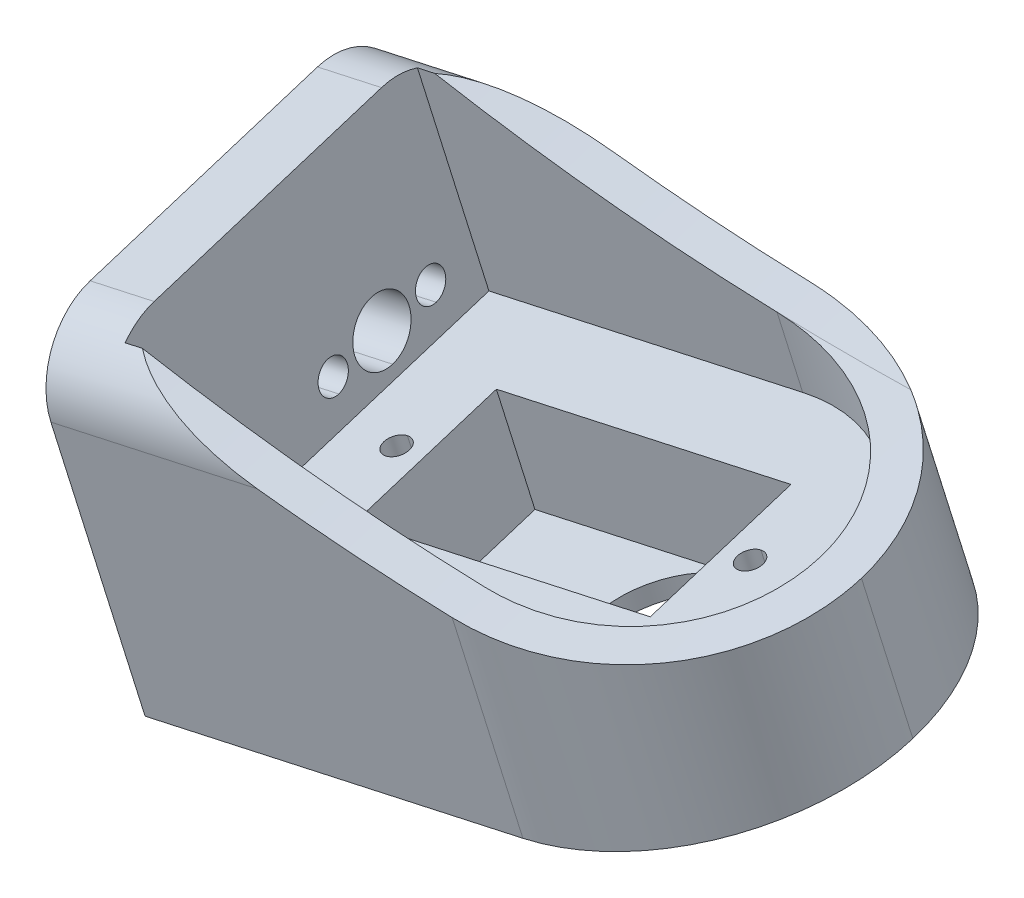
ISO-10303-21;
HEADER;
FILE_DESCRIPTION(('STEP AP214'),'2;1');
FILE_NAME('part.step','',(''),(''),'','','');
FILE_SCHEMA(('AUTOMOTIVE_DESIGN { 1 0 10303 214 1 1 1 1 }'));
ENDSEC;
DATA;
#1=APPLICATION_CONTEXT('core data for automotive mechanical design processes');
#2=APPLICATION_PROTOCOL_DEFINITION('international standard','automotive_design',2000,#1);
#3=PRODUCT_CONTEXT('',#1,'mechanical');
#4=PRODUCT('Part','Part','',(#3));
#5=PRODUCT_RELATED_PRODUCT_CATEGORY('part','',(#4));
#6=PRODUCT_DEFINITION_FORMATION('','',#4);
#7=PRODUCT_DEFINITION_CONTEXT('part definition',#1,'design');
#8=PRODUCT_DEFINITION('design','',#6,#7);
#9=PRODUCT_DEFINITION_SHAPE('','',#8);
#10=(LENGTH_UNIT() NAMED_UNIT(*) SI_UNIT(.MILLI.,.METRE.));
#11=(NAMED_UNIT(*) PLANE_ANGLE_UNIT() SI_UNIT($,.RADIAN.));
#12=(NAMED_UNIT(*) SI_UNIT($,.STERADIAN.) SOLID_ANGLE_UNIT());
#13=UNCERTAINTY_MEASURE_WITH_UNIT(LENGTH_MEASURE(1.E-05),#10,'distance_accuracy_value','');
#14=(GEOMETRIC_REPRESENTATION_CONTEXT(3) GLOBAL_UNCERTAINTY_ASSIGNED_CONTEXT((#13)) GLOBAL_UNIT_ASSIGNED_CONTEXT((#10,
#11,#12)) REPRESENTATION_CONTEXT('',''));
#15=CARTESIAN_POINT('',(0.,0.,0.));
#16=DIRECTION('',(0.,0.,1.));
#17=DIRECTION('',(1.,0.,0.));
#18=AXIS2_PLACEMENT_3D('',#15,#16,#17);
#19=CARTESIAN_POINT('',(164.219268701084,-54.3273248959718,254.291427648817));
#20=DIRECTION('',(-0.983862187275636,-0.167602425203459,0.0626468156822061));
#21=DIRECTION('',(0.152393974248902,-0.968392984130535,-0.197461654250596));
#22=AXIS2_PLACEMENT_3D('',#19,#20,#21);
#23=CYLINDRICAL_SURFACE('',#22,6.);
#24=CARTESIAN_POINT('',(123.880919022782,-61.1990243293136,256.859947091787));
#25=DIRECTION('',(0.983862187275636,0.167602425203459,-0.0626468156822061));
#26=DIRECTION('',(0.152393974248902,-0.968392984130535,-0.197461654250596));
#27=AXIS2_PLACEMENT_3D('',#24,#25,#26);
#28=CIRCLE('',#27,6.);
#29=CARTESIAN_POINT('',(122.966555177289,-55.3886664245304,258.044717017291));
#30=VERTEX_POINT('',#29);
#31=CARTESIAN_POINT('',(123.370342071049,-56.7212909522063,260.820908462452));
#32=VERTEX_POINT('',#31);
#33=EDGE_CURVE('E565',#30,#32,#28,.T.);
#34=ORIENTED_EDGE('',*,*,#33,.F.);
#35=DIRECTION('',(0.983862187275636,0.167602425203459,-0.0626468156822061));
#36=VECTOR('',#35,1.);
#37=CARTESIAN_POINT('',(163.30490485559,-48.5169669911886,255.47619757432));
#38=LINE('',#37,#36);
#39=CARTESIAN_POINT('',(118.047244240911,-56.2266785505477,258.357951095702));
#40=VERTEX_POINT('',#39);
#41=EDGE_CURVE('E182',#40,#30,#38,.T.);
#42=ORIENTED_EDGE('',*,*,#41,.F.);
#43=CARTESIAN_POINT('',(118.961608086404,-62.0370364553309,257.173181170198));
#44=DIRECTION('',(-0.983862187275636,-0.167602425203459,0.0626468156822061));
#45=DIRECTION('',(0.152393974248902,-0.968392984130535,-0.197461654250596));
#46=AXIS2_PLACEMENT_3D('',#43,#44,#45);
#47=CIRCLE('',#46,6.);
#48=CARTESIAN_POINT('',(119.524178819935,-63.1454048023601,263.043022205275));
#49=VERTEX_POINT('',#48);
#50=EDGE_CURVE('E95',#49,#40,#47,.T.);
#51=ORIENTED_EDGE('',*,*,#50,.F.);
#52=DIRECTION('',(-0.983862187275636,-0.167602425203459,0.0626468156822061));
#53=VECTOR('',#52,1.);
#54=CARTESIAN_POINT('',(164.781839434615,-55.435693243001,260.161268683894));
#55=LINE('',#54,#53);
#56=CARTESIAN_POINT('',(135.380083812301,-60.4443271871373,262.033407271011));
#57=VERTEX_POINT('',#56);
#58=EDGE_CURVE('E420',#57,#49,#55,.T.);
#59=ORIENTED_EDGE('',*,*,#58,.F.);
#60=CARTESIAN_POINT('',(124.696351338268,-56.4954032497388,260.736475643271));
#61=CARTESIAN_POINT('',(124.766792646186,-56.5309734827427,260.785764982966));
#62=CARTESIAN_POINT('',(124.838292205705,-56.5666613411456,260.833436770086));
#63=CARTESIAN_POINT('',(124.984869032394,-56.6390254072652,260.926765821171));
#64=CARTESIAN_POINT('',(125.059990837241,-56.6757052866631,260.972350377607));
#65=CARTESIAN_POINT('',(125.213813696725,-56.7500321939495,261.06150971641));
#66=CARTESIAN_POINT('',(125.292557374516,-56.7876811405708,261.105009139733));
#67=CARTESIAN_POINT('',(125.453633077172,-56.8639273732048,261.190004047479));
#68=CARTESIAN_POINT('',(125.53600560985,-56.9025248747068,261.231422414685));
#69=CARTESIAN_POINT('',(125.704347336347,-56.9806478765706,261.312261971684));
#70=CARTESIAN_POINT('',(125.790354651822,-57.0201718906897,261.351605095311));
#71=CARTESIAN_POINT('',(125.956276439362,-57.0957101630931,261.424057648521));
#72=CARTESIAN_POINT('',(126.036079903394,-57.1317343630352,261.457412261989));
#73=CARTESIAN_POINT('',(126.281751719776,-57.2417245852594,261.555808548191));
#74=CARTESIAN_POINT('',(126.449270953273,-57.3154734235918,261.617003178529));
#75=CARTESIAN_POINT('',(126.794563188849,-57.4651010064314,261.732576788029));
#76=CARTESIAN_POINT('',(126.972476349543,-57.5409446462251,261.786578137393));
#77=CARTESIAN_POINT('',(127.315780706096,-57.6850561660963,261.881514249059));
#78=CARTESIAN_POINT('',(127.480935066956,-57.753415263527,261.923172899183));
#79=CARTESIAN_POINT('',(127.817990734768,-57.8910433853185,262.000801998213));
#80=CARTESIAN_POINT('',(127.989949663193,-57.9602822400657,262.03657494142));
#81=CARTESIAN_POINT('',(128.340646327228,-58.0995841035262,262.102439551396));
#82=CARTESIAN_POINT('',(128.519434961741,-58.1696117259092,262.132333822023));
#83=CARTESIAN_POINT('',(128.88382310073,-58.3104024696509,262.186456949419));
#84=CARTESIAN_POINT('',(129.069466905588,-58.38112541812,262.210490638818));
#85=CARTESIAN_POINT('',(129.447598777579,-58.5232142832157,262.25290898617));
#86=CARTESIAN_POINT('',(129.640124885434,-58.5945356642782,262.271102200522));
#87=CARTESIAN_POINT('',(130.008266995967,-58.729031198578,262.299972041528));
#88=CARTESIAN_POINT('',(130.183789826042,-58.7923460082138,262.311190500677));
#89=CARTESIAN_POINT('',(130.538945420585,-58.9188544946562,262.329040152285));
#90=CARTESIAN_POINT('',(130.718592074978,-58.9820222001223,262.335578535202));
#91=CARTESIAN_POINT('',(131.082011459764,-59.1081808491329,262.344080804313));
#92=CARTESIAN_POINT('',(131.265795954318,-59.171143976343,262.345952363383));
#93=CARTESIAN_POINT('',(131.637509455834,-59.2968363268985,262.345128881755));
#94=CARTESIAN_POINT('',(131.825448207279,-59.3595360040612,262.342342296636));
#95=CARTESIAN_POINT('',(132.205488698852,-59.4846430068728,262.332212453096));
#96=CARTESIAN_POINT('',(132.397598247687,-59.5470191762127,262.324778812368));
#97=CARTESIAN_POINT('',(132.770856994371,-59.6665687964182,262.306117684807));
#98=CARTESIAN_POINT('',(132.951989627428,-59.7238330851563,262.295137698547));
#99=CARTESIAN_POINT('',(133.316690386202,-59.8376403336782,262.269303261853));
#100=CARTESIAN_POINT('',(133.50026077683,-59.8941654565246,262.254402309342));
#101=CARTESIAN_POINT('',(133.869847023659,-60.0064603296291,262.22073268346));
#102=CARTESIAN_POINT('',(134.055864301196,-60.0622113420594,262.201917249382));
#103=CARTESIAN_POINT('',(134.430354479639,-60.1729232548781,262.160424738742));
#104=CARTESIAN_POINT('',(134.618827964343,-60.227864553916,262.137700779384));
#105=CARTESIAN_POINT('',(134.998242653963,-60.3369225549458,262.088396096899));
#106=CARTESIAN_POINT('',(135.189183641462,-60.3910188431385,262.06176848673));
#107=CARTESIAN_POINT('',(135.380083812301,-60.4443271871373,262.033407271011));
#108=B_SPLINE_CURVE_WITH_KNOTS('',3,(#60,#61,#62,#63,#64,#65,#66,#67,#68,#69,#70,#71,#72,#73,
#74,#75,#76,#77,#78,#79,#80,#81,#82,#83,#84,#85,#86,#87,#88,#89,#90,#91,#92,#93,#94,#95,#96,#97,
#98,#99,#100,#101,#102,#103,#104,#105,#106,#107),.UNSPECIFIED.,.F.,.F.,(4,2,2,2,2,2,2,2,2,2,2,2,
2,2,2,2,2,2,2,2,2,2,2,4),(0.,0.279087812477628,0.564671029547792,0.857167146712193,
1.15696387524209,1.46442042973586,1.74547526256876,2.32414604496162,2.92631300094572,
3.47676435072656,4.04300960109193,4.62586214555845,5.22606731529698,5.84430761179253,
6.40503017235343,6.97658545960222,7.55936159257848,8.15372592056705,8.76002613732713,
9.33084208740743,9.90875945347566,10.4940236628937,11.0868722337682,11.6875349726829),.UNSPECIFIED.);
#109=CARTESIAN_POINT('',(124.696351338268,-56.4954032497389,260.736475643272));
#110=VERTEX_POINT('',#109);
#111=EDGE_CURVE('E432',#110,#57,#108,.T.);
#112=ORIENTED_EDGE('',*,*,#111,.F.);
#113=DIRECTION('',(0.983862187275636,0.167602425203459,-0.0626468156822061));
#114=VECTOR('',#113,1.);
#115=CARTESIAN_POINT('',(123.370342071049,-56.7212909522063,260.820908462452));
#116=LINE('',#115,#114);
#117=EDGE_CURVE('E361',#32,#110,#116,.T.);
#118=ORIENTED_EDGE('',*,*,#117,.F.);
#119=EDGE_LOOP('',(#34,#42,#51,#59,#112,#118));
#120=FACE_BOUND('',#119,.T.);
#121=ADVANCED_FACE('F17',(#120),#23,.T.);
#122=CARTESIAN_POINT('',(162.250271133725,-50.4480356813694,233.746984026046));
#123=DIRECTION('',(-0.983862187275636,-0.167602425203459,0.0626468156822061));
#124=DIRECTION('',(0.152393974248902,-0.968392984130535,-0.197461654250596));
#125=AXIS2_PLACEMENT_3D('',#122,#123,#124);
#126=CYLINDRICAL_SURFACE('',#125,6.);
#127=CARTESIAN_POINT('',(132.2859447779,-54.3483012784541,229.749281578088));
#128=CARTESIAN_POINT('',(132.095500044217,-54.2951271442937,229.777619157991));
#129=CARTESIAN_POINT('',(131.905357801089,-54.2418444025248,229.807808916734));
#130=CARTESIAN_POINT('',(131.528385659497,-54.1358503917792,229.871594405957));
#131=CARTESIAN_POINT('',(131.341546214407,-54.0831413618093,229.905137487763));
#132=CARTESIAN_POINT('',(130.971168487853,-53.9783323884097,229.975622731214));
#133=CARTESIAN_POINT('',(130.787619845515,-53.9262338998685,230.012512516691));
#134=CARTESIAN_POINT('',(130.423814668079,-53.822684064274,230.089684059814));
#135=CARTESIAN_POINT('',(130.243546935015,-53.7712333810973,230.129913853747));
#136=CARTESIAN_POINT('',(129.886295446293,-53.6690174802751,230.213762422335));
#137=CARTESIAN_POINT('',(129.709299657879,-53.618252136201,230.257329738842));
#138=CARTESIAN_POINT('',(129.345640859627,-53.5137215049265,230.35117286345));
#139=CARTESIAN_POINT('',(129.159040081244,-53.4599603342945,230.401694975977));
#140=CARTESIAN_POINT('',(128.790735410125,-53.3536504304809,230.506377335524));
#141=CARTESIAN_POINT('',(128.609006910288,-53.3010984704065,230.560447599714));
#142=CARTESIAN_POINT('',(128.250433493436,-53.1972684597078,230.672221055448));
#143=CARTESIAN_POINT('',(128.073561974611,-53.1459853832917,230.729834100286));
#144=CARTESIAN_POINT('',(127.724688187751,-53.0447518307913,230.848682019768));
#145=CARTESIAN_POINT('',(127.552657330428,-52.9947945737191,230.909827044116));
#146=CARTESIAN_POINT('',(127.213453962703,-52.8962718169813,231.035732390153));
#147=CARTESIAN_POINT('',(127.046250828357,-52.8476977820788,231.100403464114));
#148=CARTESIAN_POINT('',(126.694825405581,-52.7456464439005,231.242157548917));
#149=CARTESIAN_POINT('',(126.510815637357,-52.6922355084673,231.319817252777));
#150=CARTESIAN_POINT('',(126.150692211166,-52.5878689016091,231.479206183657));
#151=CARTESIAN_POINT('',(125.974504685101,-52.5368870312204,231.560750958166));
#152=CARTESIAN_POINT('',(125.63000580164,-52.4374825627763,231.727898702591));
#153=CARTESIAN_POINT('',(125.461613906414,-52.3890285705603,231.81331655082));
#154=CARTESIAN_POINT('',(125.132688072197,-52.2947798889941,231.988197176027));
#155=CARTESIAN_POINT('',(124.972066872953,-52.248948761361,232.077475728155));
#156=CARTESIAN_POINT('',(124.658661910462,-52.16003886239,232.260052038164));
#157=CARTESIAN_POINT('',(124.505784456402,-52.1169189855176,232.353168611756));
#158=CARTESIAN_POINT('',(124.188900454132,-52.0282251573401,232.555547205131));
#159=CARTESIAN_POINT('',(124.025281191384,-51.9828279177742,232.665496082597));
#160=CARTESIAN_POINT('',(123.709826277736,-51.8963655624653,232.889714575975));
#161=CARTESIAN_POINT('',(123.55778003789,-51.8552004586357,233.003647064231));
#162=CARTESIAN_POINT('',(123.336475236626,-51.7962621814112,233.179393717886));
#163=CARTESIAN_POINT('',(123.264858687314,-51.7773476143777,233.237874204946));
#164=CARTESIAN_POINT('',(123.116486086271,-51.7385346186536,233.362625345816));
#165=CARTESIAN_POINT('',(123.039887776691,-51.7187133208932,233.42910841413));
#166=CARTESIAN_POINT('',(122.890719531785,-51.6806051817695,233.56305308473));
#167=CARTESIAN_POINT('',(122.818096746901,-51.6622923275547,233.630448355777));
#168=CARTESIAN_POINT('',(122.676875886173,-51.6272255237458,233.766213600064));
#169=CARTESIAN_POINT('',(122.608222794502,-51.6104443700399,233.834519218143));
#170=CARTESIAN_POINT('',(122.474936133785,-51.5784631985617,233.972100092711));
#171=CARTESIAN_POINT('',(122.410245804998,-51.5632350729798,234.041313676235));
#172=CARTESIAN_POINT('',(122.284886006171,-51.5343832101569,234.180700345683));
#173=CARTESIAN_POINT('',(122.224158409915,-51.520730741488,234.250815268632));
#174=CARTESIAN_POINT('',(122.164783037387,-51.5077456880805,234.322190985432));
#175=B_SPLINE_CURVE_WITH_KNOTS('',3,(#127,#128,#129,#130,#131,#132,#133,#134,#135,#136,#137,
#138,#139,#140,#141,#142,#143,#144,#145,#146,#147,#148,#149,#150,#151,#152,#153,#154,#155,#156,
#157,#158,#159,#160,#161,#162,#163,#164,#165,#166,#167,#168,#169,#170,#171,#172,#173,#174),
.UNSPECIFIED.,.F.,.F.,(4,2,2,2,2,2,2,2,2,2,2,2,2,2,2,2,2,2,2,2,2,2,2,4),(0.,0.599243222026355,
1.19023146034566,1.77318985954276,2.34835160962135,2.91595820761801,3.51786871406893,
4.10806041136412,4.68687270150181,5.25466393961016,5.81181249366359,6.43193674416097,
7.03399615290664,7.61867438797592,8.18671792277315,8.73894125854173,9.34556574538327,
9.92846671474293,10.2115595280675,10.5215346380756,10.8237376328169,11.1185351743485,
11.4063232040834,11.6875282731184),.UNSPECIFIED.);
#176=CARTESIAN_POINT('',(132.285944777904,-54.3483012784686,229.749281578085));
#177=VERTEX_POINT('',#176);
#178=CARTESIAN_POINT('',(122.164783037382,-51.5077456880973,234.322190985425));
#179=VERTEX_POINT('',#178);
#180=EDGE_CURVE('E188',#177,#179,#175,.T.);
#181=ORIENTED_EDGE('',*,*,#180,.F.);
#182=DIRECTION('',(0.983862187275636,0.167602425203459,-0.0626468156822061));
#183=VECTOR('',#182,1.);
#184=CARTESIAN_POINT('',(161.687700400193,-49.3396673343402,227.877142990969));
#185=LINE('',#184,#183);
#186=CARTESIAN_POINT('',(116.430039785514,-57.0493788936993,230.75889651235));
#187=VERTEX_POINT('',#186);
#188=EDGE_CURVE('E185',#187,#177,#185,.T.);
#189=ORIENTED_EDGE('',*,*,#188,.F.);
#190=CARTESIAN_POINT('',(116.992610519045,-58.1577472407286,236.628737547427));
#191=DIRECTION('',(-0.983862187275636,-0.167602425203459,0.0626468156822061));
#192=DIRECTION('',(0.152393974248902,-0.968392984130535,-0.197461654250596));
#193=AXIS2_PLACEMENT_3D('',#190,#191,#192);
#194=CIRCLE('',#193,6.);
#195=CARTESIAN_POINT('',(116.078246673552,-52.3473893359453,237.813507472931));
#196=VERTEX_POINT('',#195);
#197=EDGE_CURVE('E172',#196,#187,#194,.T.);
#198=ORIENTED_EDGE('',*,*,#197,.F.);
#199=DIRECTION('',(-0.983862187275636,-0.167602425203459,0.0626468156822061));
#200=VECTOR('',#199,1.);
#201=CARTESIAN_POINT('',(161.335907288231,-44.6376777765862,234.93175395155));
#202=LINE('',#201,#200);
#203=CARTESIAN_POINT('',(120.99755760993,-51.509377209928,237.50027339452));
#204=VERTEX_POINT('',#203);
#205=EDGE_CURVE('E620',#204,#196,#202,.T.);
#206=ORIENTED_EDGE('',*,*,#205,.F.);
#207=CARTESIAN_POINT('',(121.911921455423,-57.3197351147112,236.315503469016));
#208=DIRECTION('',(0.983862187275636,0.167602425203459,-0.0626468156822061));
#209=DIRECTION('',(0.152393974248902,-0.968392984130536,-0.197461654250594));
#210=AXIS2_PLACEMENT_3D('',#207,#208,#209);
#211=CIRCLE('',#210,6.);
#212=CARTESIAN_POINT('',(120.838773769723,-51.7336333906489,234.406623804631));
#213=VERTEX_POINT('',#212);
#214=EDGE_CURVE('E681',#213,#204,#211,.T.);
#215=ORIENTED_EDGE('',*,*,#214,.F.);
#216=DIRECTION('',(-0.983862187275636,-0.167602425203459,0.0626468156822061));
#217=VECTOR('',#216,1.);
#218=CARTESIAN_POINT('',(122.164783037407,-51.5077456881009,234.322190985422));
#219=LINE('',#218,#217);
#220=EDGE_CURVE('E303',#179,#213,#219,.T.);
#221=ORIENTED_EDGE('',*,*,#220,.F.);
#222=EDGE_LOOP('',(#181,#189,#198,#206,#215,#221));
#223=FACE_BOUND('',#222,.T.);
#224=ADVANCED_FACE('F19',(#223),#126,.T.);
#225=CARTESIAN_POINT('',(118.305524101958,-66.089619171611,236.027351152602));
#226=DIRECTION('',(0.983862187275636,0.167602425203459,-0.0626468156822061));
#227=DIRECTION('',(-0.152393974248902,0.968392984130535,0.197461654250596));
#228=AXIS2_PLACEMENT_3D('',#225,#226,#227);
#229=CYLINDRICAL_SURFACE('',#228,1.3);
#230=DIRECTION('',(0.983862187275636,0.167602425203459,-0.0626468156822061));
#231=VECTOR('',#230,1.);
#232=CARTESIAN_POINT('',(118.503636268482,-67.3485300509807,235.770651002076));
#233=LINE('',#232,#231);
#234=CARTESIAN_POINT('',(118.503636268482,-67.3485300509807,235.770651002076));
#235=VERTEX_POINT('',#234);
#236=CARTESIAN_POINT('',(123.42294720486,-66.5105179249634,235.457416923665));
#237=VERTEX_POINT('',#236);
#238=EDGE_CURVE('E1036',#235,#237,#233,.T.);
#239=ORIENTED_EDGE('',*,*,#238,.F.);
#240=CARTESIAN_POINT('',(118.305524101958,-66.089619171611,236.027351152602));
#241=DIRECTION('',(0.983862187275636,0.167602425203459,-0.0626468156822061));
#242=DIRECTION('',(-0.152393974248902,0.968392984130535,0.197461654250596));
#243=AXIS2_PLACEMENT_3D('',#240,#241,#242);
#244=CIRCLE('',#243,1.3);
#245=CARTESIAN_POINT('',(118.107411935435,-64.8307082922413,236.284051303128));
#246=VERTEX_POINT('',#245);
#247=EDGE_CURVE('E221',#246,#235,#244,.T.);
#248=ORIENTED_EDGE('',*,*,#247,.F.);
#249=DIRECTION('',(0.983862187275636,0.167602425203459,-0.0626468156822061));
#250=VECTOR('',#249,1.);
#251=CARTESIAN_POINT('',(118.107411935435,-64.8307082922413,236.284051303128));
#252=LINE('',#251,#250);
#253=CARTESIAN_POINT('',(123.026722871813,-63.9926961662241,235.970817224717));
#254=VERTEX_POINT('',#253);
#255=EDGE_CURVE('E1020',#246,#254,#252,.T.);
#256=ORIENTED_EDGE('',*,*,#255,.T.);
#257=CARTESIAN_POINT('',(123.224835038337,-65.2516070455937,235.714117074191));
#258=DIRECTION('',(0.983862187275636,0.167602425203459,-0.0626468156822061));
#259=DIRECTION('',(-0.152393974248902,0.968392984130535,0.197461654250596));
#260=AXIS2_PLACEMENT_3D('',#257,#258,#259);
#261=CIRCLE('',#260,1.3);
#262=EDGE_CURVE('E568',#254,#237,#261,.T.);
#263=ORIENTED_EDGE('',*,*,#262,.T.);
#264=EDGE_LOOP('',(#239,#248,#256,#263));
#265=FACE_BOUND('',#264,.T.);
#266=ADVANCED_FACE('F1545',(#265),#229,.F.);
#267=CARTESIAN_POINT('',(119.149380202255,-67.7521716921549,244.832112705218));
#268=DIRECTION('',(0.983862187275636,0.167602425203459,-0.0626468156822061));
#269=DIRECTION('',(-0.152393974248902,0.968392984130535,0.197461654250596));
#270=AXIS2_PLACEMENT_3D('',#267,#268,#269);
#271=CYLINDRICAL_SURFACE('',#270,1.3);
#272=DIRECTION('',(0.983862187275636,0.167602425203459,-0.0626468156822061));
#273=VECTOR('',#272,1.);
#274=CARTESIAN_POINT('',(119.347492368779,-69.0110825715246,244.575412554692));
#275=LINE('',#274,#273);
#276=CARTESIAN_POINT('',(119.347492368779,-69.0110825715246,244.575412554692));
#277=VERTEX_POINT('',#276);
#278=CARTESIAN_POINT('',(124.266803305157,-68.1730704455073,244.262178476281));
#279=VERTEX_POINT('',#278);
#280=EDGE_CURVE('E1005',#277,#279,#275,.T.);
#281=ORIENTED_EDGE('',*,*,#280,.F.);
#282=CARTESIAN_POINT('',(119.149380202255,-67.7521716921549,244.832112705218));
#283=DIRECTION('',(0.983862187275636,0.167602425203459,-0.0626468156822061));
#284=DIRECTION('',(-0.152393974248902,0.968392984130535,0.197461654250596));
#285=AXIS2_PLACEMENT_3D('',#282,#283,#284);
#286=CIRCLE('',#285,1.3);
#287=CARTESIAN_POINT('',(118.951268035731,-66.4932608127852,245.088812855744));
#288=VERTEX_POINT('',#287);
#289=EDGE_CURVE('E222',#288,#277,#286,.T.);
#290=ORIENTED_EDGE('',*,*,#289,.F.);
#291=DIRECTION('',(0.983862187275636,0.167602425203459,-0.0626468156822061));
#292=VECTOR('',#291,1.);
#293=CARTESIAN_POINT('',(118.951268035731,-66.4932608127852,245.088812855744));
#294=LINE('',#293,#292);
#295=CARTESIAN_POINT('',(123.87057897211,-65.6552486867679,244.775578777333));
#296=VERTEX_POINT('',#295);
#297=EDGE_CURVE('E989',#288,#296,#294,.T.);
#298=ORIENTED_EDGE('',*,*,#297,.T.);
#299=CARTESIAN_POINT('',(124.068691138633,-66.9141595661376,244.518878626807));
#300=DIRECTION('',(0.983862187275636,0.167602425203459,-0.0626468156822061));
#301=DIRECTION('',(-0.152393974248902,0.968392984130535,0.197461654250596));
#302=AXIS2_PLACEMENT_3D('',#299,#300,#301);
#303=CIRCLE('',#302,1.3);
#304=EDGE_CURVE('E631',#296,#279,#303,.T.);
#305=ORIENTED_EDGE('',*,*,#304,.T.);
#306=EDGE_LOOP('',(#281,#290,#298,#305));
#307=FACE_BOUND('',#306,.T.);
#308=ADVANCED_FACE('F1536',(#307),#271,.F.);
#309=CARTESIAN_POINT('',(157.154920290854,-72.813285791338,240.745054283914));
#310=DIRECTION('',(-0.152393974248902,0.968392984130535,0.197461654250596));
#311=DIRECTION('',(0.093761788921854,-0.184728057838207,0.978306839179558));
#312=AXIS2_PLACEMENT_3D('',#309,#310,#311);
#313=PLANE('',#312);
#314=CARTESIAN_POINT('',(157.154920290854,-72.813285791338,240.745054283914));
#315=DIRECTION('',(-0.152393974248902,0.968392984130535,0.197461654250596));
#316=DIRECTION('',(0.093761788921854,-0.184728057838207,0.978306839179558));
#317=AXIS2_PLACEMENT_3D('',#314,#315,#316);
#318=CIRCLE('',#317,1.00000000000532);
#319=CARTESIAN_POINT('',(157.248682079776,-72.9980138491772,241.723361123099));
#320=VERTEX_POINT('',#319);
#321=CARTESIAN_POINT('',(157.061158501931,-72.6285577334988,239.76674744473));
#322=VERTEX_POINT('',#321);
#323=EDGE_CURVE('E10',#320,#322,#318,.T.);
#324=ORIENTED_EDGE('',*,*,#323,.T.);
#325=CARTESIAN_POINT('',(157.154920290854,-72.813285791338,240.745054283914));
#326=DIRECTION('',(-0.152393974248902,0.968392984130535,0.197461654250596));
#327=DIRECTION('',(0.093761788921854,-0.184728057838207,0.978306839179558));
#328=AXIS2_PLACEMENT_3D('',#325,#326,#327);
#329=CIRCLE('',#328,1.00000000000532);
#330=EDGE_CURVE('E980',#322,#320,#329,.T.);
#331=ORIENTED_EDGE('',*,*,#330,.T.);
#332=EDGE_LOOP('',(#324,#331));
#333=FACE_BOUND('',#332,.T.);
#334=ADVANCED_FACE('F1527',(#333),#313,.T.);
#335=CARTESIAN_POINT('',(157.154920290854,-72.813285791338,240.745054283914));
#336=DIRECTION('',(-0.152393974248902,0.968392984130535,0.197461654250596));
#337=DIRECTION('',(0.093761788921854,-0.184728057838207,0.978306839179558));
#338=AXIS2_PLACEMENT_3D('',#335,#336,#337);
#339=CYLINDRICAL_SURFACE('',#338,1.00000000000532);
#340=DIRECTION('',(-0.152393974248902,0.968392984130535,0.197461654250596));
#341=VECTOR('',#340,1.);
#342=CARTESIAN_POINT('',(157.061158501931,-72.6285577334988,239.76674744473));
#343=LINE('',#342,#341);
#344=CARTESIAN_POINT('',(155.84200670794,-64.8814138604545,241.346440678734));
#345=VERTEX_POINT('',#344);
#346=EDGE_CURVE('E972',#322,#345,#343,.T.);
#347=ORIENTED_EDGE('',*,*,#346,.F.);
#348=ORIENTED_EDGE('',*,*,#323,.F.);
#349=DIRECTION('',(-0.152393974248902,0.968392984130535,0.197461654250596));
#350=VECTOR('',#349,1.);
#351=CARTESIAN_POINT('',(157.248682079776,-72.9980138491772,241.723361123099));
#352=LINE('',#351,#350);
#353=CARTESIAN_POINT('',(156.029530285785,-65.2508699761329,243.303054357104));
#354=VERTEX_POINT('',#353);
#355=EDGE_CURVE('E954',#320,#354,#352,.T.);
#356=ORIENTED_EDGE('',*,*,#355,.T.);
#357=CARTESIAN_POINT('',(155.935768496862,-65.0661419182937,242.324747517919));
#358=DIRECTION('',(-0.152393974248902,0.968392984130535,0.197461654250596));
#359=DIRECTION('',(0.093761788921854,-0.184728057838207,0.978306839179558));
#360=AXIS2_PLACEMENT_3D('',#357,#358,#359);
#361=CIRCLE('',#360,1.00000000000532);
#362=EDGE_CURVE('E654',#354,#345,#361,.T.);
#363=ORIENTED_EDGE('',*,*,#362,.T.);
#364=EDGE_LOOP('',(#347,#348,#356,#363));
#365=FACE_BOUND('',#364,.T.);
#366=ADVANCED_FACE('F1460',(#365),#339,.F.);
#367=CARTESIAN_POINT('',(130.000323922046,-77.4391127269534,242.474106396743));
#368=DIRECTION('',(-0.152393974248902,0.968392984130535,0.197461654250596));
#369=DIRECTION('',(0.093761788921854,-0.184728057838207,0.978306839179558));
#370=AXIS2_PLACEMENT_3D('',#367,#368,#369);
#371=PLANE('',#370);
#372=CARTESIAN_POINT('',(130.000323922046,-77.4391127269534,242.474106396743));
#373=DIRECTION('',(-0.152393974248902,0.968392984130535,0.197461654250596));
#374=DIRECTION('',(0.093761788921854,-0.184728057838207,0.978306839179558));
#375=AXIS2_PLACEMENT_3D('',#372,#373,#374);
#376=CIRCLE('',#375,1.00000000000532);
#377=CARTESIAN_POINT('',(130.094085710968,-77.6238407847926,243.452413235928));
#378=VERTEX_POINT('',#377);
#379=CARTESIAN_POINT('',(129.906562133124,-77.2543846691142,241.495799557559));
#380=VERTEX_POINT('',#379);
#381=EDGE_CURVE('E28',#378,#380,#376,.T.);
#382=ORIENTED_EDGE('',*,*,#381,.T.);
#383=CARTESIAN_POINT('',(130.000323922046,-77.4391127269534,242.474106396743));
#384=DIRECTION('',(-0.152393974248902,0.968392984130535,0.197461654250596));
#385=DIRECTION('',(0.093761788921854,-0.184728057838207,0.978306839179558));
#386=AXIS2_PLACEMENT_3D('',#383,#384,#385);
#387=CIRCLE('',#386,1.00000000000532);
#388=EDGE_CURVE('E946',#380,#378,#387,.T.);
#389=ORIENTED_EDGE('',*,*,#388,.T.);
#390=EDGE_LOOP('',(#382,#389));
#391=FACE_BOUND('',#390,.T.);
#392=ADVANCED_FACE('F401',(#391),#371,.T.);
#393=CARTESIAN_POINT('',(130.000323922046,-77.4391127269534,242.474106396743));
#394=DIRECTION('',(-0.152393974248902,0.968392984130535,0.197461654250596));
#395=DIRECTION('',(0.093761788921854,-0.184728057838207,0.978306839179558));
#396=AXIS2_PLACEMENT_3D('',#393,#394,#395);
#397=CYLINDRICAL_SURFACE('',#396,1.00000000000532);
#398=DIRECTION('',(-0.152393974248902,0.968392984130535,0.197461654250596));
#399=VECTOR('',#398,1.);
#400=CARTESIAN_POINT('',(129.906562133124,-77.2543846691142,241.495799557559));
#401=LINE('',#400,#399);
#402=CARTESIAN_POINT('',(128.687410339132,-69.50724079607,243.075492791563));
#403=VERTEX_POINT('',#402);
#404=EDGE_CURVE('E938',#380,#403,#401,.T.);
#405=ORIENTED_EDGE('',*,*,#404,.F.);
#406=ORIENTED_EDGE('',*,*,#381,.F.);
#407=DIRECTION('',(-0.152393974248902,0.968392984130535,0.197461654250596));
#408=VECTOR('',#407,1.);
#409=CARTESIAN_POINT('',(130.094085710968,-77.6238407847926,243.452413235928));
#410=LINE('',#409,#408);
#411=CARTESIAN_POINT('',(128.874933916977,-69.8766969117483,245.032106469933));
#412=VERTEX_POINT('',#411);
#413=EDGE_CURVE('E921',#378,#412,#410,.T.);
#414=ORIENTED_EDGE('',*,*,#413,.T.);
#415=CARTESIAN_POINT('',(128.781172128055,-69.6919688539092,244.053799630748));
#416=DIRECTION('',(-0.152393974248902,0.968392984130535,0.197461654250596));
#417=DIRECTION('',(0.093761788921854,-0.184728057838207,0.978306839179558));
#418=AXIS2_PLACEMENT_3D('',#415,#416,#417);
#419=CIRCLE('',#418,1.00000000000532);
#420=EDGE_CURVE('E658',#412,#403,#419,.T.);
#421=ORIENTED_EDGE('',*,*,#420,.T.);
#422=EDGE_LOOP('',(#405,#406,#414,#421));
#423=FACE_BOUND('',#422,.T.);
#424=ADVANCED_FACE('F1459',(#423),#397,.F.);
#425=CARTESIAN_POINT('',(148.87791797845,-76.7091695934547,240.802692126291));
#426=DIRECTION('',(-0.152393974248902,0.968392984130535,0.197461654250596));
#427=DIRECTION('',(0.093761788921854,-0.184728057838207,0.978306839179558));
#428=AXIS2_PLACEMENT_3D('',#425,#426,#427);
#429=CYLINDRICAL_SURFACE('',#428,6.50000000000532);
#430=DIRECTION('',(-0.152393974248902,0.968392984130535,0.197461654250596));
#431=VECTOR('',#430,1.);
#432=CARTESIAN_POINT('',(148.268466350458,-75.5084372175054,234.443697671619));
#433=LINE('',#432,#431);
#434=CARTESIAN_POINT('',(148.268466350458,-75.5084372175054,234.443697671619));
#435=VERTEX_POINT('',#434);
#436=CARTESIAN_POINT('',(148.039875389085,-74.0558477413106,234.739890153));
#437=VERTEX_POINT('',#436);
#438=EDGE_CURVE('E570',#435,#437,#433,.T.);
#439=ORIENTED_EDGE('',*,*,#438,.F.);
#440=CARTESIAN_POINT('',(148.87791797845,-76.7091695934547,240.802692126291));
#441=DIRECTION('',(-0.152393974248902,0.968392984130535,0.197461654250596));
#442=DIRECTION('',(0.093761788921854,-0.184728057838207,0.978306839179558));
#443=AXIS2_PLACEMENT_3D('',#440,#441,#442);
#444=CIRCLE('',#443,6.50000000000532);
#445=CARTESIAN_POINT('',(149.487369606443,-77.9099019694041,247.161686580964));
#446=VERTEX_POINT('',#445);
#447=EDGE_CURVE('E623',#446,#435,#444,.T.);
#448=ORIENTED_EDGE('',*,*,#447,.F.);
#449=DIRECTION('',(-0.152393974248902,0.968392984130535,0.197461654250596));
#450=VECTOR('',#449,1.);
#451=CARTESIAN_POINT('',(149.487369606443,-77.9099019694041,247.161686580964));
#452=LINE('',#451,#450);
#453=CARTESIAN_POINT('',(149.258778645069,-76.4573124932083,247.45787906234));
#454=VERTEX_POINT('',#453);
#455=EDGE_CURVE('E578',#446,#454,#452,.T.);
#456=ORIENTED_EDGE('',*,*,#455,.T.);
#457=CARTESIAN_POINT('',(148.649327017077,-75.2565801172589,241.098884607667));
#458=DIRECTION('',(-0.152393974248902,0.968392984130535,0.197461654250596));
#459=DIRECTION('',(0.093761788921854,-0.184728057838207,0.978306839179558));
#460=AXIS2_PLACEMENT_3D('',#457,#458,#459);
#461=CIRCLE('',#460,6.50000000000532);
#462=CARTESIAN_POINT('',(155.044431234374,-74.1671643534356,240.691680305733));
#463=VERTEX_POINT('',#462);
#464=EDGE_CURVE('E599',#454,#463,#461,.T.);
#465=ORIENTED_EDGE('',*,*,#464,.T.);
#466=CARTESIAN_POINT('',(148.649327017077,-75.2565801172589,241.098884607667));
#467=DIRECTION('',(-0.152393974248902,0.968392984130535,0.197461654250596));
#468=DIRECTION('',(0.093761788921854,-0.184728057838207,0.978306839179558));
#469=AXIS2_PLACEMENT_3D('',#466,#467,#468);
#470=CIRCLE('',#469,6.50000000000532);
#471=EDGE_CURVE('E608',#463,#437,#470,.T.);
#472=ORIENTED_EDGE('',*,*,#471,.T.);
#473=EDGE_LOOP('',(#439,#448,#456,#465,#472));
#474=FACE_BOUND('',#473,.T.);
#475=ADVANCED_FACE('F1503',(#474),#429,.F.);
#476=CARTESIAN_POINT('',(121.101185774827,-79.9494480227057,242.852995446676));
#477=DIRECTION('',(0.152393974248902,-0.968392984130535,-0.197461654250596));
#478=DIRECTION('',(-0.983862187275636,-0.167602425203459,0.0626468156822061));
#479=AXIS2_PLACEMENT_3D('',#476,#477,#478);
#480=PLANE('',#479);
#481=CARTESIAN_POINT('',(148.649327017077,-75.2565801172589,241.098884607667));
#482=DIRECTION('',(-0.152393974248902,0.968392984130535,0.197461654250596));
#483=DIRECTION('',(0.093761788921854,-0.184728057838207,0.978306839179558));
#484=AXIS2_PLACEMENT_3D('',#481,#482,#483);
#485=CIRCLE('',#484,6.50000000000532);
#486=EDGE_CURVE('E574',#437,#454,#485,.T.);
#487=ORIENTED_EDGE('',*,*,#486,.F.);
#488=DIRECTION('',(-0.983862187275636,-0.167602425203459,0.0626468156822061));
#489=VECTOR('',#488,1.);
#490=CARTESIAN_POINT('',(131.806149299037,-76.8212877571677,235.773562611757));
#491=LINE('',#490,#489);
#492=CARTESIAN_POINT('',(131.806149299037,-76.8212877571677,235.773562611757));
#493=VERTEX_POINT('',#492);
#494=EDGE_CURVE('E42',#437,#493,#491,.T.);
#495=ORIENTED_EDGE('',*,*,#494,.T.);
#496=DIRECTION('',(0.093761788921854,-0.184728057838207,0.978306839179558));
#497=VECTOR('',#496,1.);
#498=CARTESIAN_POINT('',(131.806149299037,-76.8212877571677,235.773562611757));
#499=LINE('',#498,#497);
#500=CARTESIAN_POINT('',(133.025052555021,-79.2227525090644,248.491551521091));
#501=VERTEX_POINT('',#500);
#502=EDGE_CURVE('E53',#493,#501,#499,.T.);
#503=ORIENTED_EDGE('',*,*,#502,.T.);
#504=DIRECTION('',(0.983862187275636,0.167602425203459,-0.0626468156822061));
#505=VECTOR('',#504,1.);
#506=CARTESIAN_POINT('',(133.025052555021,-79.2227525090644,248.491551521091));
#507=LINE('',#506,#505);
#508=EDGE_CURVE('E230',#501,#454,#507,.T.);
#509=ORIENTED_EDGE('',*,*,#508,.T.);
#510=EDGE_LOOP('',(#487,#495,#503,#509));
#511=FACE_BOUND('',#510,.T.);
#512=ADVANCED_FACE('F1494',(#511),#480,.F.);
#513=CARTESIAN_POINT('',(154.434979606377,-72.9664319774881,234.332685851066));
#514=DIRECTION('',(0.983862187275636,0.167602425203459,-0.0626468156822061));
#515=DIRECTION('',(0.093761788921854,-0.184728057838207,0.978306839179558));
#516=AXIS2_PLACEMENT_3D('',#513,#514,#515);
#517=PLANE('',#516);
#518=DIRECTION('',(-0.093761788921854,0.184728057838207,-0.978306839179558));
#519=VECTOR('',#518,1.);
#520=CARTESIAN_POINT('',(153.063433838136,-64.2508951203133,236.109840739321));
#521=LINE('',#520,#519);
#522=CARTESIAN_POINT('',(154.28233709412,-66.65235987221,248.827829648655));
#523=VERTEX_POINT('',#522);
#524=CARTESIAN_POINT('',(153.063433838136,-64.2508951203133,236.109840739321));
#525=VERTEX_POINT('',#524);
#526=EDGE_CURVE('E670',#523,#525,#521,.T.);
#527=ORIENTED_EDGE('',*,*,#526,.T.);
#528=DIRECTION('',(-0.152393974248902,0.968392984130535,0.197461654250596));
#529=VECTOR('',#528,1.);
#530=CARTESIAN_POINT('',(154.434979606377,-72.9664319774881,234.332685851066));
#531=LINE('',#530,#529);
#532=CARTESIAN_POINT('',(154.434979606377,-72.9664319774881,234.332685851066));
#533=VERTEX_POINT('',#532);
#534=EDGE_CURVE('E238',#533,#525,#531,.T.);
#535=ORIENTED_EDGE('',*,*,#534,.F.);
#536=DIRECTION('',(-0.093761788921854,0.184728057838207,-0.978306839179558));
#537=VECTOR('',#536,1.);
#538=CARTESIAN_POINT('',(154.434979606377,-72.9664319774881,234.332685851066));
#539=LINE('',#538,#537);
#540=EDGE_CURVE('E612',#463,#533,#539,.T.);
#541=ORIENTED_EDGE('',*,*,#540,.F.);
#542=DIRECTION('',(-0.093761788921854,0.184728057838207,-0.978306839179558));
#543=VECTOR('',#542,1.);
#544=CARTESIAN_POINT('',(154.434979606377,-72.9664319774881,234.332685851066));
#545=LINE('',#544,#543);
#546=CARTESIAN_POINT('',(155.653882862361,-75.3678967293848,247.0506747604));
#547=VERTEX_POINT('',#546);
#548=EDGE_CURVE('E604',#547,#463,#545,.T.);
#549=ORIENTED_EDGE('',*,*,#548,.F.);
#550=DIRECTION('',(-0.152393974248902,0.968392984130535,0.197461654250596));
#551=VECTOR('',#550,1.);
#552=CARTESIAN_POINT('',(155.653882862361,-75.3678967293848,247.0506747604));
#553=LINE('',#552,#551);
#554=EDGE_CURVE('E227',#547,#523,#553,.T.);
#555=ORIENTED_EDGE('',*,*,#554,.T.);
#556=EDGE_LOOP('',(#527,#535,#541,#549,#555));
#557=FACE_BOUND('',#556,.T.);
#558=ADVANCED_FACE('F1485',(#557),#517,.F.);
#559=CARTESIAN_POINT('',(131.806149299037,-76.8212877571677,235.773562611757));
#560=DIRECTION('',(-0.093761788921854,0.184728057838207,-0.978306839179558));
#561=DIRECTION('',(-0.152393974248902,0.968392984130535,0.197461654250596));
#562=AXIS2_PLACEMENT_3D('',#559,#560,#561);
#563=PLANE('',#562);
#564=DIRECTION('',(-0.983862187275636,-0.167602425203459,0.0626468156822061));
#565=VECTOR('',#564,1.);
#566=CARTESIAN_POINT('',(130.434603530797,-68.1057508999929,237.550717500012));
#567=LINE('',#566,#565);
#568=CARTESIAN_POINT('',(130.434603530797,-68.1057508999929,237.550717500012));
#569=VERTEX_POINT('',#568);
#570=EDGE_CURVE('E666',#525,#569,#567,.T.);
#571=ORIENTED_EDGE('',*,*,#570,.T.);
#572=DIRECTION('',(-0.152393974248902,0.968392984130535,0.197461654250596));
#573=VECTOR('',#572,1.);
#574=CARTESIAN_POINT('',(131.806149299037,-76.8212877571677,235.773562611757));
#575=LINE('',#574,#573);
#576=EDGE_CURVE('E234',#493,#569,#575,.T.);
#577=ORIENTED_EDGE('',*,*,#576,.F.);
#578=ORIENTED_EDGE('',*,*,#494,.F.);
#579=DIRECTION('',(-0.983862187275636,-0.167602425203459,0.0626468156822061));
#580=VECTOR('',#579,1.);
#581=CARTESIAN_POINT('',(131.806149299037,-76.8212877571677,235.773562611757));
#582=LINE('',#581,#580);
#583=EDGE_CURVE('E619',#533,#437,#582,.T.);
#584=ORIENTED_EDGE('',*,*,#583,.F.);
#585=ORIENTED_EDGE('',*,*,#534,.T.);
#586=EDGE_LOOP('',(#571,#577,#578,#584,#585));
#587=FACE_BOUND('',#586,.T.);
#588=ADVANCED_FACE('F1476',(#587),#563,.F.);
#589=CARTESIAN_POINT('',(131.806149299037,-76.8212877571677,235.773562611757));
#590=DIRECTION('',(-0.983862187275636,-0.167602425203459,0.0626468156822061));
#591=DIRECTION('',(0.152393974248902,-0.968392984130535,-0.197461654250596));
#592=AXIS2_PLACEMENT_3D('',#589,#590,#591);
#593=PLANE('',#592);
#594=DIRECTION('',(0.093761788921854,-0.184728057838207,0.978306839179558));
#595=VECTOR('',#594,1.);
#596=CARTESIAN_POINT('',(130.434603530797,-68.1057508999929,237.550717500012));
#597=LINE('',#596,#595);
#598=CARTESIAN_POINT('',(131.653506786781,-70.5072156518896,250.268706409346));
#599=VERTEX_POINT('',#598);
#600=EDGE_CURVE('E665',#569,#599,#597,.T.);
#601=ORIENTED_EDGE('',*,*,#600,.T.);
#602=DIRECTION('',(-0.152393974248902,0.968392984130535,0.197461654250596));
#603=VECTOR('',#602,1.);
#604=CARTESIAN_POINT('',(133.025052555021,-79.2227525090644,248.491551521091));
#605=LINE('',#604,#603);
#606=EDGE_CURVE('E231',#501,#599,#605,.T.);
#607=ORIENTED_EDGE('',*,*,#606,.F.);
#608=ORIENTED_EDGE('',*,*,#502,.F.);
#609=ORIENTED_EDGE('',*,*,#576,.T.);
#610=EDGE_LOOP('',(#601,#607,#608,#609));
#611=FACE_BOUND('',#610,.T.);
#612=ADVANCED_FACE('F1468',(#611),#593,.F.);
#613=CARTESIAN_POINT('',(133.025052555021,-79.2227525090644,248.491551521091));
#614=DIRECTION('',(0.093761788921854,-0.184728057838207,0.978306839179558));
#615=DIRECTION('',(0.983862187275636,0.167602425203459,-0.0626468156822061));
#616=AXIS2_PLACEMENT_3D('',#613,#614,#615);
#617=PLANE('',#616);
#618=DIRECTION('',(0.983862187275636,0.167602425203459,-0.0626468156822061));
#619=VECTOR('',#618,1.);
#620=CARTESIAN_POINT('',(131.653506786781,-70.5072156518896,250.268706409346));
#621=LINE('',#620,#619);
#622=EDGE_CURVE('E661',#599,#523,#621,.T.);
#623=ORIENTED_EDGE('',*,*,#622,.T.);
#624=ORIENTED_EDGE('',*,*,#554,.F.);
#625=DIRECTION('',(0.983862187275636,0.167602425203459,-0.0626468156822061));
#626=VECTOR('',#625,1.);
#627=CARTESIAN_POINT('',(133.025052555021,-79.2227525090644,248.491551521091));
#628=LINE('',#627,#626);
#629=EDGE_CURVE('E603',#454,#547,#628,.T.);
#630=ORIENTED_EDGE('',*,*,#629,.F.);
#631=ORIENTED_EDGE('',*,*,#508,.F.);
#632=ORIENTED_EDGE('',*,*,#606,.T.);
#633=EDGE_LOOP('',(#623,#624,#630,#631,#632));
#634=FACE_BOUND('',#633,.T.);
#635=ADVANCED_FACE('F504',(#634),#617,.F.);
#636=CARTESIAN_POINT('',(148.220195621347,-62.900264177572,243.473185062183));
#637=DIRECTION('',(-0.152393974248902,0.968392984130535,0.197461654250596));
#638=DIRECTION('',(0.093761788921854,-0.184728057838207,0.978306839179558));
#639=AXIS2_PLACEMENT_3D('',#636,#637,#638);
#640=CYLINDRICAL_SURFACE('',#639,16.5);
#641=CARTESIAN_POINT('',(150.353711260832,-76.4577659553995,240.708721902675));
#642=DIRECTION('',(0.152393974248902,-0.968392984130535,-0.197461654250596));
#643=DIRECTION('',(0.093761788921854,-0.184728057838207,0.978306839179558));
#644=AXIS2_PLACEMENT_3D('',#641,#642,#643);
#645=CIRCLE('',#644,16.5);
#646=CARTESIAN_POINT('',(148.806641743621,-73.409753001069,224.566659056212));
#647=VERTEX_POINT('',#646);
#648=CARTESIAN_POINT('',(166.58743735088,-73.6923259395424,239.675049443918));
#649=VERTEX_POINT('',#648);
#650=EDGE_CURVE('E217',#647,#649,#645,.T.);
#651=ORIENTED_EDGE('',*,*,#650,.F.);
#652=DIRECTION('',(0.152393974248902,-0.968392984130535,-0.197461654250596));
#653=VECTOR('',#652,1.);
#654=CARTESIAN_POINT('',(144.539610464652,-46.2947494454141,230.095585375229));
#655=LINE('',#654,#653);
#656=CARTESIAN_POINT('',(146.290019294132,-57.4177852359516,227.827525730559));
#657=VERTEX_POINT('',#656);
#658=EDGE_CURVE('E615',#657,#647,#655,.T.);
#659=ORIENTED_EDGE('',*,*,#658,.F.);
#660=CARTESIAN_POINT('',(156.3432329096,-59.1664600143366,229.600347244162));
#661=CARTESIAN_POINT('',(156.152790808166,-59.1286829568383,229.500187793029));
#662=CARTESIAN_POINT('',(155.960354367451,-59.0909917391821,229.403789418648));
#663=CARTESIAN_POINT('',(155.571781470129,-59.0157754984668,229.218635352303));
#664=CARTESIAN_POINT('',(155.375644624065,-58.9782504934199,229.129880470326));
#665=CARTESIAN_POINT('',(154.979687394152,-58.9033100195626,228.960021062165));
#666=CARTESIAN_POINT('',(154.779861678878,-58.8658948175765,228.878928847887));
#667=CARTESIAN_POINT('',(154.376548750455,-58.7911151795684,228.724389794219));
#668=CARTESIAN_POINT('',(154.173052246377,-58.753751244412,228.650966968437));
#669=CARTESIAN_POINT('',(153.764971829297,-58.679479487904,228.512633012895));
#670=CARTESIAN_POINT('',(153.560409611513,-58.6425704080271,228.447658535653));
#671=CARTESIAN_POINT('',(153.148794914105,-58.568895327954,228.325612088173));
#672=CARTESIAN_POINT('',(152.941741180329,-58.5321294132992,228.26854429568));
#673=CARTESIAN_POINT('',(152.525159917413,-58.4586941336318,228.162307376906));
#674=CARTESIAN_POINT('',(152.315628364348,-58.422025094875,228.113153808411));
#675=CARTESIAN_POINT('',(151.894106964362,-58.3487362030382,228.022741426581));
#676=CARTESIAN_POINT('',(151.682111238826,-58.3121169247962,227.981509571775));
#677=CARTESIAN_POINT('',(151.256494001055,-58.2390200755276,227.907081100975));
#678=CARTESIAN_POINT('',(151.042871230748,-58.2025426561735,227.873891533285));
#679=CARTESIAN_POINT('',(150.614331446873,-58.1297530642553,227.815623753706));
#680=CARTESIAN_POINT('',(150.399413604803,-58.0934410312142,227.790551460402));
#681=CARTESIAN_POINT('',(149.968294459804,-58.0209491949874,227.748513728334));
#682=CARTESIAN_POINT('',(149.752091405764,-57.9847698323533,227.731565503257));
#683=CARTESIAN_POINT('',(149.318411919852,-57.9125086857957,227.705764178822));
#684=CARTESIAN_POINT('',(149.100933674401,-57.8764276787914,227.696939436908));
#685=CARTESIAN_POINT('',(148.66772203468,-57.8048303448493,227.687467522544));
#686=CARTESIAN_POINT('',(148.451990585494,-57.7693118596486,227.686747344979));
#687=CARTESIAN_POINT('',(148.020238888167,-57.6984816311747,227.693301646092));
#688=CARTESIAN_POINT('',(147.804218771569,-57.6631703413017,227.700589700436));
#689=CARTESIAN_POINT('',(147.371895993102,-57.5927340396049,227.723149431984));
#690=CARTESIAN_POINT('',(147.15559444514,-57.557609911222,227.738445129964));
#691=CARTESIAN_POINT('',(146.722709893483,-57.4875275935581,227.777006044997));
#692=CARTESIAN_POINT('',(146.506129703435,-57.4525707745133,227.800305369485));
#693=CARTESIAN_POINT('',(146.290019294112,-57.4177852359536,227.82752573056));
#694=B_SPLINE_CURVE_WITH_KNOTS('',3,(#660,#661,#662,#663,#664,#665,#666,#667,#668,#669,#670,
#671,#672,#673,#674,#675,#676,#677,#678,#679,#680,#681,#682,#683,#684,#685,#686,#687,#688,#689,
#690,#691,#692,#693),.UNSPECIFIED.,.F.,.F.,(4,2,2,2,2,2,2,2,2,2,2,2,2,2,2,2,4),(0.,
0.655354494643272,1.3107783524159,1.967238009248,2.62569509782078,3.27888874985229,
3.93242623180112,4.58723315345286,5.24423045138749,5.90180147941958,6.55985089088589,
7.21928851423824,7.88101946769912,8.53678479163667,9.19366349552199,9.85252404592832,
10.5142278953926),.UNSPECIFIED.);
#695=CARTESIAN_POINT('',(156.343232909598,-59.1664600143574,229.600347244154));
#696=VERTEX_POINT('',#695);
#697=EDGE_CURVE('E249',#696,#657,#694,.T.);
#698=ORIENTED_EDGE('',*,*,#697,.F.);
#699=CARTESIAN_POINT('',(164.758709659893,-62.0716101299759,242.044589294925));
#700=CARTESIAN_POINT('',(164.74313327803,-62.0409148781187,241.882030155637));
#701=CARTESIAN_POINT('',(164.725040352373,-62.0101417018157,241.719725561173));
#702=CARTESIAN_POINT('',(164.683862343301,-61.9485536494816,241.396246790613));
#703=CARTESIAN_POINT('',(164.660791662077,-61.9177391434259,241.235070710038));
#704=CARTESIAN_POINT('',(164.609659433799,-61.8560662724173,240.913848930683));
#705=CARTESIAN_POINT('',(164.581607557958,-61.8252081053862,240.753801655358));
#706=CARTESIAN_POINT('',(164.520519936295,-61.7634439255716,240.434837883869));
#707=CARTESIAN_POINT('',(164.487489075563,-61.7325379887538,240.275920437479));
#708=CARTESIAN_POINT('',(164.416449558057,-61.6706726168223,239.959216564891));
#709=CARTESIAN_POINT('',(164.37844101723,-61.6397131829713,239.801430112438));
#710=CARTESIAN_POINT('',(164.297453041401,-61.5777334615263,239.486988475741));
#711=CARTESIAN_POINT('',(164.254469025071,-61.5467131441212,239.330334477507));
#712=CARTESIAN_POINT('',(164.163537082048,-61.4846026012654,239.018157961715));
#713=CARTESIAN_POINT('',(164.115580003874,-61.453512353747,238.862638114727));
#714=CARTESIAN_POINT('',(164.014709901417,-61.3912512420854,238.552730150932));
#715=CARTESIAN_POINT('',(163.961783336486,-61.3600803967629,238.398346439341));
#716=CARTESIAN_POINT('',(163.85103673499,-61.2976775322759,238.090868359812));
#717=CARTESIAN_POINT('',(163.793203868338,-61.2664455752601,237.937778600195));
#718=CARTESIAN_POINT('',(163.672945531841,-61.2041080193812,237.633899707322));
#719=CARTESIAN_POINT('',(163.610533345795,-61.1730023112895,237.483105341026));
#720=CARTESIAN_POINT('',(163.481125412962,-61.1109025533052,237.183818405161));
#721=CARTESIAN_POINT('',(163.414138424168,-61.079908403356,237.035322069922));
#722=CARTESIAN_POINT('',(163.275589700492,-61.018015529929,236.740632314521));
#723=CARTESIAN_POINT('',(163.204032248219,-60.9871167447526,236.594436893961));
#724=CARTESIAN_POINT('',(163.056351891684,-60.9253968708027,236.304350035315));
#725=CARTESIAN_POINT('',(162.980228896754,-60.894575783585,236.160458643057));
#726=CARTESIAN_POINT('',(162.823427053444,-60.8329920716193,235.874980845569));
#727=CARTESIAN_POINT('',(162.742743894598,-60.8022295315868,235.733396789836));
#728=CARTESIAN_POINT('',(162.576831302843,-60.7407421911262,235.452534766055));
#729=CARTESIAN_POINT('',(162.491593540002,-60.7100175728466,235.313261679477));
#730=CARTESIAN_POINT('',(162.316582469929,-60.6485838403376,235.037022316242));
#731=CARTESIAN_POINT('',(162.226797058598,-60.6178750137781,234.900063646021));
#732=CARTESIAN_POINT('',(162.043176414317,-60.5566088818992,234.629161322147));
#733=CARTESIAN_POINT('',(161.949347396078,-60.5260514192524,234.495213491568));
#734=CARTESIAN_POINT('',(161.757803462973,-60.4651239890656,234.230600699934));
#735=CARTESIAN_POINT('',(161.660098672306,-60.4347537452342,234.09992847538));
#736=CARTESIAN_POINT('',(161.460814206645,-60.3741775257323,233.841868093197));
#737=CARTESIAN_POINT('',(161.359240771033,-60.3439713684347,233.714475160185));
#738=CARTESIAN_POINT('',(161.152229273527,-60.283698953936,233.462974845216));
#739=CARTESIAN_POINT('',(161.046793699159,-60.2536326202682,233.338865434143));
#740=CARTESIAN_POINT('',(160.832068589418,-60.1936143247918,233.093933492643));
#741=CARTESIAN_POINT('',(160.722777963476,-60.1636623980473,232.973111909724));
#742=CARTESIAN_POINT('',(160.50035352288,-60.1038462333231,232.73475690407));
#743=CARTESIAN_POINT('',(160.387215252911,-60.0739821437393,232.617227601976));
#744=CARTESIAN_POINT('',(160.157106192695,-60.0143138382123,232.385458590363));
#745=CARTESIAN_POINT('',(160.040127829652,-59.9845098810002,232.271226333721));
#746=CARTESIAN_POINT('',(159.802350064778,-59.9249328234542,232.046052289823));
#747=CARTESIAN_POINT('',(159.681540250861,-59.895160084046,231.935121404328));
#748=CARTESIAN_POINT('',(159.437072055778,-59.8358493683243,231.717411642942));
#749=CARTESIAN_POINT('',(159.313426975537,-59.8063109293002,231.610617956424));
#750=CARTESIAN_POINT('',(159.063152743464,-59.7474066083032,231.401041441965));
#751=CARTESIAN_POINT('',(158.93652967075,-59.7180405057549,231.29825141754));
#752=CARTESIAN_POINT('',(158.680310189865,-59.6594547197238,231.096682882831));
#753=CARTESIAN_POINT('',(158.550716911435,-59.6302349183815,230.997900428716));
#754=CARTESIAN_POINT('',(158.28856715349,-59.5719149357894,230.804348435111));
#755=CARTESIAN_POINT('',(158.156011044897,-59.5428147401,230.709578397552));
#756=CARTESIAN_POINT('',(157.887945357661,-59.4847061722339,230.524051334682));
#757=CARTESIAN_POINT('',(157.752433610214,-59.4556978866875,230.433297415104));
#758=CARTESIAN_POINT('',(157.478468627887,-59.3977454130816,230.255806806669));
#759=CARTESIAN_POINT('',(157.34001093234,-59.3688014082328,230.169076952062));
#760=CARTESIAN_POINT('',(156.919613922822,-59.2818907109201,229.914523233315));
#761=CARTESIAN_POINT('',(156.633751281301,-59.2240833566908,229.753096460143));
#762=CARTESIAN_POINT('',(156.343232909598,-59.1664600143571,229.600347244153));
#763=B_SPLINE_CURVE_WITH_KNOTS('',3,(#699,#700,#701,#702,#703,#704,#705,#706,#707,#708,#709,
#710,#711,#712,#713,#714,#715,#716,#717,#718,#719,#720,#721,#722,#723,#724,#725,#726,#727,#728,
#729,#730,#731,#732,#733,#734,#735,#736,#737,#738,#739,#740,#741,#742,#743,#744,#745,#746,#747,
#748,#749,#750,#751,#752,#753,#754,#755,#756,#757,#758,#759,#760,#761,#762),.UNSPECIFIED.,.F.,
.F.,(4,2,2,2,2,2,2,2,2,2,2,2,2,2,2,2,2,2,2,2,2,2,2,2,2,2,2,2,2,2,2,4),(0.,0.498473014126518,
0.99552268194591,1.49161765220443,1.98722901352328,2.48282883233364,2.97888867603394,
3.47587814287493,3.97426341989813,4.47399472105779,4.97232971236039,5.46973607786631,
5.96668301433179,6.46363982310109,6.96107449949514,7.45945234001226,7.95923458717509,
8.45827434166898,8.95608679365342,9.45312780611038,9.94985412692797,10.4467221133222,
10.9441864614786,11.4426989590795,11.9427072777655,12.4407190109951,12.9377898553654,
13.4343590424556,13.9308664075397,14.4277512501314,14.9254512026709,15.9249217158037),.UNSPECIFIED.);
#764=CARTESIAN_POINT('',(164.758709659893,-62.071610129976,242.044589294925));
#765=VERTEX_POINT('',#764);
#766=EDGE_CURVE('E536',#765,#696,#763,.T.);
#767=ORIENTED_EDGE('',*,*,#766,.F.);
#768=DIRECTION('',(0.152393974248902,-0.968392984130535,-0.197461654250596));
#769=VECTOR('',#768,1.);
#770=CARTESIAN_POINT('',(164.453921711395,-60.1348241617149,242.439512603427));
#771=LINE('',#770,#769);
#772=EDGE_CURVE('E79',#765,#649,#771,.T.);
#773=ORIENTED_EDGE('',*,*,#772,.T.);
#774=EDGE_LOOP('',(#651,#659,#698,#767,#773));
#775=FACE_BOUND('',#774,.T.);
#776=ADVANCED_FACE('F400',(#775),#640,.T.);
#777=CARTESIAN_POINT('',(148.220195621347,-62.900264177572,243.473185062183));
#778=DIRECTION('',(0.152393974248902,-0.968392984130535,-0.197461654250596));
#779=DIRECTION('',(-0.093761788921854,0.184728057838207,-0.978306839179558));
#780=AXIS2_PLACEMENT_3D('',#777,#778,#779);
#781=CYLINDRICAL_SURFACE('',#780,16.5);
#782=DIRECTION('',(-0.152393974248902,0.968392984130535,0.197461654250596));
#783=VECTOR('',#782,1.);
#784=CARTESIAN_POINT('',(147.633749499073,-52.3907753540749,262.379711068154));
#785=LINE('',#784,#783);
#786=CARTESIAN_POINT('',(151.900780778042,-79.5057789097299,256.850784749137));
#787=VERTEX_POINT('',#786);
#788=CARTESIAN_POINT('',(149.384158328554,-63.513811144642,260.111651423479));
#789=VERTEX_POINT('',#788);
#790=EDGE_CURVE('E202',#787,#789,#785,.T.);
#791=ORIENTED_EDGE('',*,*,#790,.F.);
#792=CARTESIAN_POINT('',(150.353711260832,-76.4577659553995,240.708721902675));
#793=DIRECTION('',(0.152393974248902,-0.968392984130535,-0.197461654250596));
#794=DIRECTION('',(0.093761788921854,-0.184728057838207,0.978306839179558));
#795=AXIS2_PLACEMENT_3D('',#792,#793,#794);
#796=CIRCLE('',#795,16.5);
#797=EDGE_CURVE('E214',#649,#787,#796,.T.);
#798=ORIENTED_EDGE('',*,*,#797,.F.);
#799=ORIENTED_EDGE('',*,*,#772,.F.);
#800=CARTESIAN_POINT('',(149.384158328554,-63.513811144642,260.111651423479));
#801=CARTESIAN_POINT('',(149.654924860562,-63.5573860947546,260.077491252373));
#802=CARTESIAN_POINT('',(149.925276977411,-63.5989516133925,260.037427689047));
#803=CARTESIAN_POINT('',(150.463337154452,-63.6777915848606,259.945658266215));
#804=CARTESIAN_POINT('',(150.73105164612,-63.7150846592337,259.894006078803));
#805=CARTESIAN_POINT('',(151.263828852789,-63.7854174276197,259.779057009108));
#806=CARTESIAN_POINT('',(151.528896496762,-63.8184674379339,259.715789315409));
#807=CARTESIAN_POINT('',(152.056370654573,-63.8803601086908,259.57763456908));
#808=CARTESIAN_POINT('',(152.318778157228,-63.9092043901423,259.502752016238));
#809=CARTESIAN_POINT('',(152.843068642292,-63.9629486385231,259.340721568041));
#810=CARTESIAN_POINT('',(153.104920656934,-63.9878066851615,259.253459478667));
#811=CARTESIAN_POINT('',(153.623574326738,-64.0330718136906,259.067651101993));
#812=CARTESIAN_POINT('',(153.8803940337,-64.0534994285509,258.969160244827));
#813=CARTESIAN_POINT('',(154.388966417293,-64.0899906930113,258.760907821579));
#814=CARTESIAN_POINT('',(154.640730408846,-64.1060654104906,258.651175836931));
#815=CARTESIAN_POINT('',(155.139177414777,-64.1339369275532,258.420455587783));
#816=CARTESIAN_POINT('',(155.385862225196,-64.1457352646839,258.29947138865));
#817=CARTESIAN_POINT('',(155.874173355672,-64.1651395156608,258.046241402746));
#818=CARTESIAN_POINT('',(156.115788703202,-64.1727370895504,257.913973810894));
#819=CARTESIAN_POINT('',(156.591741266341,-64.1837039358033,257.63908206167));
#820=CARTESIAN_POINT('',(156.826105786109,-64.1870916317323,257.496505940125));
#821=CARTESIAN_POINT('',(157.287537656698,-64.1897569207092,257.201005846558));
#822=CARTESIAN_POINT('',(157.514619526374,-64.1890432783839,257.048104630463));
#823=CARTESIAN_POINT('',(157.961469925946,-64.1836210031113,256.731963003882));
#824=CARTESIAN_POINT('',(158.181237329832,-64.1789117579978,256.568721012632));
#825=CARTESIAN_POINT('',(158.61540829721,-64.1655498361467,256.230378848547));
#826=CARTESIAN_POINT('',(158.829721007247,-64.1568523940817,256.055163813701));
#827=CARTESIAN_POINT('',(159.248845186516,-64.1356376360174,255.695513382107));
#828=CARTESIAN_POINT('',(159.453689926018,-64.1231350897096,255.51111590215));
#829=CARTESIAN_POINT('',(159.853860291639,-64.0944487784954,255.13310476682));
#830=CARTESIAN_POINT('',(160.049199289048,-64.0782703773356,254.939504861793));
#831=CARTESIAN_POINT('',(160.430344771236,-64.0423655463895,254.543093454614));
#832=CARTESIAN_POINT('',(160.616141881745,-64.0226357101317,254.340273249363));
#833=CARTESIAN_POINT('',(160.977063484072,-63.9798891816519,253.926721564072));
#834=CARTESIAN_POINT('',(161.15221736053,-63.956882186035,253.716014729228));
#835=CARTESIAN_POINT('',(161.491304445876,-63.9077641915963,253.287194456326));
#836=CARTESIAN_POINT('',(161.655271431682,-63.8816632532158,253.069106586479));
#837=CARTESIAN_POINT('',(161.971973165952,-63.8264935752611,252.625525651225));
#838=CARTESIAN_POINT('',(162.1247159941,-63.7974270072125,252.400038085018));
#839=CARTESIAN_POINT('',(162.418962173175,-63.736454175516,251.941658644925));
#840=CARTESIAN_POINT('',(162.560445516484,-63.7045430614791,251.708754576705));
#841=CARTESIAN_POINT('',(162.832656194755,-63.6378828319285,251.234701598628));
#842=CARTESIAN_POINT('',(162.963291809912,-63.6031136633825,250.993502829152));
#843=CARTESIAN_POINT('',(163.211728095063,-63.5312325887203,250.505768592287));
#844=CARTESIAN_POINT('',(163.329563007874,-63.4941273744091,250.259249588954));
#845=CARTESIAN_POINT('',(163.552396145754,-63.4176938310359,249.760874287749));
#846=CARTESIAN_POINT('',(163.657396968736,-63.3783659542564,249.509019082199));
#847=CARTESIAN_POINT('',(163.854566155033,-63.297596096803,248.99997048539));
#848=CARTESIAN_POINT('',(163.946703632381,-63.25614934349,248.742765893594));
#849=CARTESIAN_POINT('',(164.117461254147,-63.1715835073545,248.225120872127));
#850=CARTESIAN_POINT('',(164.196124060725,-63.1284702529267,247.964693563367));
#851=CARTESIAN_POINT('',(164.339736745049,-63.0407365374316,247.441059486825));
#852=CARTESIAN_POINT('',(164.404720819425,-62.9961201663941,247.177861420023));
#853=CARTESIAN_POINT('',(164.52098798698,-62.9054627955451,246.648685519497));
#854=CARTESIAN_POINT('',(164.572270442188,-62.8594217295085,246.382707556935));
#855=CARTESIAN_POINT('',(164.661151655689,-62.7659850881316,245.847970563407));
#856=CARTESIAN_POINT('',(164.698713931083,-62.718586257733,245.579206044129));
#857=CARTESIAN_POINT('',(164.760250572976,-62.6223767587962,245.038246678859));
#858=CARTESIAN_POINT('',(164.784119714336,-62.5735581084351,244.766041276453));
#859=CARTESIAN_POINT('',(164.817546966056,-62.4751459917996,244.221622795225));
#860=CARTESIAN_POINT('',(164.827142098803,-62.4255548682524,243.94941157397));
#861=CARTESIAN_POINT('',(164.832040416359,-62.3256340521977,243.404983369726));
#862=CARTESIAN_POINT('',(164.827342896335,-62.2753043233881,243.132766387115));
#863=CARTESIAN_POINT('',(164.803721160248,-62.1739257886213,242.58831988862));
#864=CARTESIAN_POINT('',(164.78475846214,-62.12287540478,242.316092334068));
#865=CARTESIAN_POINT('',(164.758709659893,-62.0716101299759,242.044589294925));
#866=B_SPLINE_CURVE_WITH_KNOTS('',3,(#800,#801,#802,#803,#804,#805,#806,#807,#808,#809,#810,
#811,#812,#813,#814,#815,#816,#817,#818,#819,#820,#821,#822,#823,#824,#825,#826,#827,#828,#829,
#830,#831,#832,#833,#834,#835,#836,#837,#838,#839,#840,#841,#842,#843,#844,#845,#846,#847,#848,
#849,#850,#851,#852,#853,#854,#855,#856,#857,#858,#859,#860,#861,#862,#863,#864,#865),
.UNSPECIFIED.,.F.,.F.,(4,2,2,2,2,2,2,2,2,2,2,2,2,2,2,2,2,2,2,2,2,2,2,2,2,2,2,2,2,2,2,2,4),(0.,
0.82904868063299,1.65433415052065,2.47757346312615,3.30049463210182,4.13157083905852,
4.95870894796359,5.78372375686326,6.60844164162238,7.43479104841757,8.257511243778,
9.07847392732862,9.89956241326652,10.730101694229,11.5574574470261,12.3836136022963,
13.2105664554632,14.0351214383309,14.8570652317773,15.6784114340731,16.501185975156,
17.3303283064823,18.157194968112,18.9838939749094,19.8125450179,20.6385219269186,
21.4624087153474,22.2863338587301,23.1124341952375,23.9448004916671,24.7750040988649,
25.6052486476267,26.4377409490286),.UNSPECIFIED.);
#867=EDGE_CURVE('E528',#789,#765,#866,.T.);
#868=ORIENTED_EDGE('',*,*,#867,.F.);
#869=EDGE_LOOP('',(#791,#798,#799,#868));
#870=FACE_BOUND('',#869,.T.);
#871=ADVANCED_FACE('F396',(#870),#781,.T.);
#872=CARTESIAN_POINT('',(147.242894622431,-56.6899698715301,244.739504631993));
#873=DIRECTION('',(0.152393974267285,-0.968392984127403,-0.197461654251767));
#874=DIRECTION('',(0.983862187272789,0.167602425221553,-0.0626468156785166));
#875=AXIS2_PLACEMENT_3D('',#872,#873,#874);
#876=CYLINDRICAL_SURFACE('',#875,13.5);
#877=CARTESIAN_POINT('',(148.753574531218,-66.2896396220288,242.782069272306));
#878=DIRECTION('',(-0.152393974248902,0.968392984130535,0.197461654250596));
#879=DIRECTION('',(-0.983862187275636,-0.167602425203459,0.0626468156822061));
#880=AXIS2_PLACEMENT_3D('',#877,#878,#879);
#881=CIRCLE('',#880,13.5);
#882=CARTESIAN_POINT('',(162.03571405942,-64.0270068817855,241.936337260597));
#883=VERTEX_POINT('',#882);
#884=CARTESIAN_POINT('',(147.487790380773,-63.795810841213,229.574926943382));
#885=VERTEX_POINT('',#884);
#886=EDGE_CURVE('E635',#883,#885,#881,.T.);
#887=ORIENTED_EDGE('',*,*,#886,.F.);
#888=DIRECTION('',(-0.152393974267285,0.968392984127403,0.197461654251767));
#889=VECTOR('',#888,1.);
#890=CARTESIAN_POINT('',(161.707692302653,-61.9425808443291,242.361365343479));
#891=LINE('',#890,#889);
#892=CARTESIAN_POINT('',(161.707692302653,-61.9425808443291,242.361365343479));
#893=VERTEX_POINT('',#892);
#894=EDGE_CURVE('E343',#883,#893,#891,.T.);
#895=ORIENTED_EDGE('',*,*,#894,.T.);
#896=CARTESIAN_POINT('',(146.571304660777,-57.9719694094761,230.762446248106));
#897=CARTESIAN_POINT('',(146.793032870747,-58.0076471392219,230.734443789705));
#898=CARTESIAN_POINT('',(147.015347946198,-58.043680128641,230.71149964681));
#899=CARTESIAN_POINT('',(147.459757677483,-58.1162585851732,230.675941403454));
#900=CARTESIAN_POINT('',(147.681849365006,-58.1528012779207,230.663284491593));
#901=CARTESIAN_POINT('',(148.125807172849,-58.226421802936,230.648293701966));
#902=CARTESIAN_POINT('',(148.347672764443,-58.2634983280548,230.645937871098));
#903=CARTESIAN_POINT('',(148.791167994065,-58.3382069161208,230.651519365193));
#904=CARTESIAN_POINT('',(149.012797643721,-58.3758389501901,230.659456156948));
#905=CARTESIAN_POINT('',(149.457366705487,-58.4519455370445,230.685691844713));
#906=CARTESIAN_POINT('',(149.680299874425,-58.4904246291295,230.704083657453));
#907=CARTESIAN_POINT('',(150.123949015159,-58.5676945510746,230.751320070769));
#908=CARTESIAN_POINT('',(150.344670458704,-58.6064831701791,230.780116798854));
#909=CARTESIAN_POINT('',(150.78388181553,-58.684421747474,230.848132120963));
#910=CARTESIAN_POINT('',(151.002375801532,-58.7235706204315,230.887325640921));
#911=CARTESIAN_POINT('',(151.437119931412,-58.8022784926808,230.976102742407));
#912=CARTESIAN_POINT('',(151.653370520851,-58.8418374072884,231.025684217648));
#913=CARTESIAN_POINT('',(152.083607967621,-58.9214118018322,231.135204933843));
#914=CARTESIAN_POINT('',(152.297589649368,-58.9614280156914,231.195163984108));
#915=CARTESIAN_POINT('',(152.721383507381,-59.0416561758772,231.325114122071));
#916=CARTESIAN_POINT('',(152.93120991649,-59.081866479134,231.395059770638));
#917=CARTESIAN_POINT('',(153.346677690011,-59.1625538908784,231.544947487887));
#918=CARTESIAN_POINT('',(153.552327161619,-59.2030302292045,231.62486749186));
#919=CARTESIAN_POINT('',(153.959427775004,-59.284318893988,231.794668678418));
#920=CARTESIAN_POINT('',(154.160878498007,-59.3251312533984,231.884550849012));
#921=CARTESIAN_POINT('',(154.561447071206,-59.4075448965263,232.075133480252));
#922=CARTESIAN_POINT('',(154.760509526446,-59.4491498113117,232.175948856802));
#923=CARTESIAN_POINT('',(155.152479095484,-59.5325013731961,232.386987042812));
#924=CARTESIAN_POINT('',(155.345407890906,-59.5742467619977,232.497170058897));
#925=CARTESIAN_POINT('',(155.725096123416,-59.6579650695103,232.726905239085));
#926=CARTESIAN_POINT('',(155.911865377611,-59.6999374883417,232.846441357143));
#927=CARTESIAN_POINT('',(156.279223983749,-59.7841921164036,233.094844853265));
#928=CARTESIAN_POINT('',(156.45980873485,-59.8264745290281,233.223718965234));
#929=CARTESIAN_POINT('',(156.813863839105,-59.9112059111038,233.490064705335));
#930=CARTESIAN_POINT('',(156.987348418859,-59.9536543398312,233.627517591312));
#931=CARTESIAN_POINT('',(157.326468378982,-60.0386495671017,233.910545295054));
#932=CARTESIAN_POINT('',(157.492129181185,-60.0811954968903,234.056089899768));
#933=CARTESIAN_POINT('',(157.815592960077,-60.1664713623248,234.355264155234));
#934=CARTESIAN_POINT('',(157.973404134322,-60.2092010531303,234.508885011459));
#935=CARTESIAN_POINT('',(158.28116352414,-60.2949250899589,234.824176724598));
#936=CARTESIAN_POINT('',(158.43110037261,-60.3379197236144,234.985858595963));
#937=CARTESIAN_POINT('',(158.723867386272,-60.4244726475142,235.318096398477));
#938=CARTESIAN_POINT('',(158.866621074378,-60.4680325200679,235.488719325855));
#939=CARTESIAN_POINT('',(159.142623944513,-60.5551695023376,235.836587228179));
#940=CARTESIAN_POINT('',(159.275901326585,-60.5987461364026,236.013809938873));
#941=CARTESIAN_POINT('',(159.532951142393,-60.685992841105,236.374844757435));
#942=CARTESIAN_POINT('',(159.656728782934,-60.729662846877,236.558653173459));
#943=CARTESIAN_POINT('',(159.894783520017,-60.8171658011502,236.932828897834));
#944=CARTESIAN_POINT('',(160.009040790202,-60.8609989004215,237.123208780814));
#945=CARTESIAN_POINT('',(160.227248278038,-60.9485639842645,237.509060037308));
#946=CARTESIAN_POINT('',(160.331227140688,-60.9922958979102,237.704515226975));
#947=CARTESIAN_POINT('',(160.528563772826,-61.0796102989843,238.100038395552));
#948=CARTESIAN_POINT('',(160.621950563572,-61.1231928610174,238.300091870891));
#949=CARTESIAN_POINT('',(160.79811354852,-61.2102612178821,238.704786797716));
#950=CARTESIAN_POINT('',(160.88089194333,-61.2537470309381,238.909427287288));
#951=CARTESIAN_POINT('',(161.035852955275,-61.3406668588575,239.323274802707));
#952=CARTESIAN_POINT('',(161.10800953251,-61.3841004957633,239.532491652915));
#953=CARTESIAN_POINT('',(161.242005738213,-61.4711223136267,239.956297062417));
#954=CARTESIAN_POINT('',(161.303748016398,-61.5147084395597,240.170916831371));
#955=CARTESIAN_POINT('',(161.415669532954,-61.6014401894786,240.6025928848));
#956=CARTESIAN_POINT('',(161.46587983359,-61.6445866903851,240.819640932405));
#957=CARTESIAN_POINT('',(161.55475308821,-61.7304618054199,241.256158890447));
#958=CARTESIAN_POINT('',(161.593416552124,-61.7731904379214,241.47562869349));
#959=CARTESIAN_POINT('',(161.659250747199,-61.8582439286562,241.916979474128));
#960=CARTESIAN_POINT('',(161.686390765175,-61.900567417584,242.138865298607));
#961=CARTESIAN_POINT('',(161.707692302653,-61.9425808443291,242.361365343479));
#962=B_SPLINE_CURVE_WITH_KNOTS('',3,(#896,#897,#898,#899,#900,#901,#902,#903,#904,#905,#906,
#907,#908,#909,#910,#911,#912,#913,#914,#915,#916,#917,#918,#919,#920,#921,#922,#923,#924,#925,
#926,#927,#928,#929,#930,#931,#932,#933,#934,#935,#936,#937,#938,#939,#940,#941,#942,#943,#944,
#945,#946,#947,#948,#949,#950,#951,#952,#953,#954,#955,#956,#957,#958,#959,#960,#961),
.UNSPECIFIED.,.F.,.F.,(4,2,2,2,2,2,2,2,2,2,2,2,2,2,2,2,2,2,2,2,2,2,2,2,2,2,2,2,2,2,2,2,4),(0.,
0.678908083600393,1.35497614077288,2.02960269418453,2.70419429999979,3.38487707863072,
4.06246713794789,4.73843767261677,5.4142712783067,6.09140947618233,6.76555945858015,
7.43824371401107,8.11099474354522,8.79166685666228,9.46957960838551,10.146353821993,
10.8236210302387,11.4994571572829,12.1729202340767,12.8456645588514,13.5193547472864,
14.1991336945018,14.8767968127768,15.5540858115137,16.2327517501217,16.9094695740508,
17.5842860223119,18.2589622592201,18.9352658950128,19.6175777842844,20.2980296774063,
20.9784515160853,21.6606756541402),.UNSPECIFIED.);
#963=CARTESIAN_POINT('',(146.571304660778,-57.9719694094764,230.762446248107));
#964=VERTEX_POINT('',#963);
#965=EDGE_CURVE('E371',#964,#893,#962,.T.);
#966=ORIENTED_EDGE('',*,*,#965,.F.);
#967=DIRECTION('',(-0.152393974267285,0.968392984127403,0.197461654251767));
#968=VECTOR('',#967,1.);
#969=CARTESIAN_POINT('',(147.159768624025,-61.7113848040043,229.999955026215));
#970=LINE('',#969,#968);
#971=EDGE_CURVE('E385',#885,#964,#970,.T.);
#972=ORIENTED_EDGE('',*,*,#971,.F.);
#973=EDGE_LOOP('',(#887,#895,#966,#972));
#974=FACE_BOUND('',#973,.T.);
#975=ADVANCED_FACE('F387',(#974),#876,.F.);
#976=CARTESIAN_POINT('',(148.220195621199,-62.9002641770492,243.473185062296));
#977=DIRECTION('',(0.152393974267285,-0.968392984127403,-0.197461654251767));
#978=DIRECTION('',(0.983862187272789,0.167602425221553,-0.0626468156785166));
#979=AXIS2_PLACEMENT_3D('',#976,#977,#978);
#980=CYLINDRICAL_SURFACE('',#979,13.5);
#981=ORIENTED_EDGE('',*,*,#894,.F.);
#982=CARTESIAN_POINT('',(148.753574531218,-66.2896396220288,242.782069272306));
#983=DIRECTION('',(-0.152393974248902,0.968392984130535,0.197461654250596));
#984=DIRECTION('',(-0.983862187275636,-0.167602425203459,0.0626468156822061));
#985=AXIS2_PLACEMENT_3D('',#982,#983,#984);
#986=CIRCLE('',#985,13.5);
#987=CARTESIAN_POINT('',(150.019358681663,-68.7834684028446,255.98921160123));
#988=VERTEX_POINT('',#987);
#989=EDGE_CURVE('E627',#988,#883,#986,.T.);
#990=ORIENTED_EDGE('',*,*,#989,.F.);
#991=DIRECTION('',(0.152393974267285,-0.968392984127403,-0.197461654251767));
#992=VECTOR('',#991,1.);
#993=CARTESIAN_POINT('',(150.019358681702,-68.7834684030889,255.98921160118));
#994=LINE('',#993,#992);
#995=CARTESIAN_POINT('',(149.102872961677,-62.9596269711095,257.176730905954));
#996=VERTEX_POINT('',#995);
#997=EDGE_CURVE('E314',#996,#988,#994,.T.);
#998=ORIENTED_EDGE('',*,*,#997,.F.);
#999=CARTESIAN_POINT('',(161.707692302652,-61.9425808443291,242.361365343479));
#1000=CARTESIAN_POINT('',(161.728866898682,-61.984254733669,242.582067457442));
#1001=CARTESIAN_POINT('',(161.744296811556,-62.0256248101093,242.803381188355));
#1002=CARTESIAN_POINT('',(161.763564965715,-62.1075276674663,243.246074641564));
#1003=CARTESIAN_POINT('',(161.76743302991,-62.1480623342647,243.467452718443));
#1004=CARTESIAN_POINT('',(161.763585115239,-62.2282836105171,243.910276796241));
#1005=CARTESIAN_POINT('',(161.755868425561,-62.2679701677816,244.131722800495));
#1006=CARTESIAN_POINT('',(161.72889549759,-62.3464753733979,244.57468310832));
#1007=CARTESIAN_POINT('',(161.709608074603,-62.3852913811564,244.796195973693));
#1008=CARTESIAN_POINT('',(161.659593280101,-62.4619275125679,245.238717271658));
#1009=CARTESIAN_POINT('',(161.628835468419,-62.4997446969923,245.459722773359));
#1010=CARTESIAN_POINT('',(161.555934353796,-62.5740366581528,245.899519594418));
#1011=CARTESIAN_POINT('',(161.513818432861,-62.6105144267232,246.118314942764));
#1012=CARTESIAN_POINT('',(161.418244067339,-62.6820847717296,246.553700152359));
#1013=CARTESIAN_POINT('',(161.364782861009,-62.7171770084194,246.770289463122));
#1014=CARTESIAN_POINT('',(161.24656406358,-62.7859264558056,247.201276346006));
#1015=CARTESIAN_POINT('',(161.181774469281,-62.8195792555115,247.415665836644));
#1016=CARTESIAN_POINT('',(161.041771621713,-62.8850033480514,247.839749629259));
#1017=CARTESIAN_POINT('',(160.966627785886,-62.9167853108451,248.049465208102));
#1018=CARTESIAN_POINT('',(160.805862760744,-62.9784782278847,248.464639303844));
#1019=CARTESIAN_POINT('',(160.72026250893,-63.0083927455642,248.670105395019));
#1020=CARTESIAN_POINT('',(160.538632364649,-63.0662860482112,249.076799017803));
#1021=CARTESIAN_POINT('',(160.442596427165,-63.0942636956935,249.278024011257));
#1022=CARTESIAN_POINT('',(160.24014326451,-63.1482128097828,249.676258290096));
#1023=CARTESIAN_POINT('',(160.133694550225,-63.1741777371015,249.873252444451));
#1024=CARTESIAN_POINT('',(159.910808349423,-63.2239466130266,250.262440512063));
#1025=CARTESIAN_POINT('',(159.794346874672,-63.2477450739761,250.454621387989));
#1026=CARTESIAN_POINT('',(159.552062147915,-63.2929212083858,250.832901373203));
#1027=CARTESIAN_POINT('',(159.426252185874,-63.3143022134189,251.019008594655));
#1028=CARTESIAN_POINT('',(159.165318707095,-63.3545661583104,251.385167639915));
#1029=CARTESIAN_POINT('',(159.030185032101,-63.3734463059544,251.565212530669));
#1030=CARTESIAN_POINT('',(158.75065216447,-63.4086270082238,251.919277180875));
#1031=CARTESIAN_POINT('',(158.606221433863,-63.4249180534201,252.093272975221));
#1032=CARTESIAN_POINT('',(158.309978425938,-63.454648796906,252.433156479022));
#1033=CARTESIAN_POINT('',(158.15821910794,-63.4681060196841,252.599088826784));
#1034=CARTESIAN_POINT('',(157.846918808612,-63.4921631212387,252.923484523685));
#1035=CARTESIAN_POINT('',(157.687383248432,-63.5027649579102,253.081952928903));
#1036=CARTESIAN_POINT('',(157.360573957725,-63.5210353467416,253.39145093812));
#1037=CARTESIAN_POINT('',(157.19328745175,-63.5286988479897,253.542467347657));
#1038=CARTESIAN_POINT('',(156.851018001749,-63.5410137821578,253.837094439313));
#1039=CARTESIAN_POINT('',(156.676006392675,-63.5456527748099,253.980672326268));
#1040=CARTESIAN_POINT('',(156.320708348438,-63.5517948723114,254.25858911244));
#1041=CARTESIAN_POINT('',(156.140467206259,-63.5533196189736,254.39298545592));
#1042=CARTESIAN_POINT('',(155.773975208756,-63.5532135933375,254.653289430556));
#1043=CARTESIAN_POINT('',(155.587724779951,-63.5515830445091,254.77919766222));
#1044=CARTESIAN_POINT('',(155.209249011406,-63.5451028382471,255.022556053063));
#1045=CARTESIAN_POINT('',(155.017011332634,-63.5402460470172,255.139986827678));
#1046=CARTESIAN_POINT('',(154.626593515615,-63.5272480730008,255.366422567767));
#1047=CARTESIAN_POINT('',(154.428390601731,-63.5190922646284,255.475387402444));
#1048=CARTESIAN_POINT('',(154.028046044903,-63.4995252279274,255.683894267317));
#1049=CARTESIAN_POINT('',(153.825918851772,-63.4881243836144,255.783465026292));
#1050=CARTESIAN_POINT('',(153.41751614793,-63.4620204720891,255.973358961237));
#1051=CARTESIAN_POINT('',(153.211239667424,-63.44731662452,256.063679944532));
#1052=CARTESIAN_POINT('',(152.794562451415,-63.4145636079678,256.235102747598));
#1053=CARTESIAN_POINT('',(152.584152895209,-63.3965063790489,256.316181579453));
#1054=CARTESIAN_POINT('',(152.159231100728,-63.3570027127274,256.469149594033));
#1055=CARTESIAN_POINT('',(151.944704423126,-63.3355410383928,256.540994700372));
#1056=CARTESIAN_POINT('',(151.514483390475,-63.2894953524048,256.674617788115));
#1057=CARTESIAN_POINT('',(151.298806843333,-63.2649335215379,256.736460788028));
#1058=CARTESIAN_POINT('',(150.865292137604,-63.2125927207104,256.850515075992));
#1059=CARTESIAN_POINT('',(150.647453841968,-63.1848135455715,256.902725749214));
#1060=CARTESIAN_POINT('',(150.20962824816,-63.1260208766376,256.997534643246));
#1061=CARTESIAN_POINT('',(149.9896373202,-63.0950005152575,257.040111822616));
#1062=CARTESIAN_POINT('',(149.547514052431,-63.0297139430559,257.115695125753));
#1063=CARTESIAN_POINT('',(149.325376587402,-62.9954345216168,257.148659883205));
#1064=CARTESIAN_POINT('',(149.102872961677,-62.9596269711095,257.176730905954));
#1065=B_SPLINE_CURVE_WITH_KNOTS('',3,(#999,#1000,#1001,#1002,#1003,#1004,#1005,#1006,#1007,
#1008,#1009,#1010,#1011,#1012,#1013,#1014,#1015,#1016,#1017,#1018,#1019,#1020,#1021,#1022,#1023,
#1024,#1025,#1026,#1027,#1028,#1029,#1030,#1031,#1032,#1033,#1034,#1035,#1036,#1037,#1038,#1039,
#1040,#1041,#1042,#1043,#1044,#1045,#1046,#1047,#1048,#1049,#1050,#1051,#1052,#1053,#1054,#1055,
#1056,#1057,#1058,#1059,#1060,#1061,#1062,#1063,#1064),.UNSPECIFIED.,.F.,.F.,(4,2,2,2,2,2,2,2,2,
2,2,2,2,2,2,2,2,2,2,2,2,2,2,2,2,2,2,2,2,2,2,2,4),(0.,0.676724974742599,1.35170287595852,
2.02672219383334,2.70356900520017,3.38222496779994,4.05925923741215,4.7364585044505,
5.41560274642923,6.09039731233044,6.76386218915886,7.43771928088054,8.11368117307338,
8.79131021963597,9.46799371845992,10.1454264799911,10.8252925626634,11.5008221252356,
12.1758873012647,12.8521077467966,13.5310923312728,14.2053421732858,14.8795442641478,
15.5552421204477,16.2339689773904,16.9105478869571,17.5872868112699,18.2656738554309,
18.9471875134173,19.624075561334,20.3010067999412,20.9794026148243,21.6606761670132),.UNSPECIFIED.);
#1066=EDGE_CURVE('E327',#893,#996,#1065,.T.);
#1067=ORIENTED_EDGE('',*,*,#1066,.F.);
#1068=EDGE_LOOP('',(#981,#990,#998,#1067));
#1069=FACE_BOUND('',#1068,.T.);
#1070=ADVANCED_FACE('F269',(#1069),#980,.F.);
#1071=CARTESIAN_POINT('',(121.967341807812,-51.4336064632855,234.355113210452));
#1072=CARTESIAN_POINT('',(121.686056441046,-50.8794222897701,231.420192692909));
#1073=CARTESIAN_POINT('',(138.614381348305,-57.7001919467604,231.576362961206));
#1074=CARTESIAN_POINT('',(138.333095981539,-57.146007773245,228.641442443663));
#1075=CARTESIAN_POINT('',(156.555933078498,-59.1842253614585,229.576607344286));
#1076=CARTESIAN_POINT('',(156.274647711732,-58.6300411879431,226.641686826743));
#1077=(BOUNDED_SURFACE() B_SPLINE_SURFACE(2,1,((#1071,#1072),(#1073,#1074),(#1075,#1076)),
.UNSPECIFIED.,.F.,.F.,.F.) B_SPLINE_SURFACE_WITH_KNOTS((3,3),(2,2),(0.499528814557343,
0.500648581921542),(0.,1.),
.UNSPECIFIED.) GEOMETRIC_REPRESENTATION_ITEM() RATIONAL_B_SPLINE_SURFACE(((1.,1.),(1.,1.),(1.,1.))) REPRESENTATION_ITEM('') SURFACE());
#1078=CARTESIAN_POINT('',(132.285944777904,-54.3483012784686,229.749281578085));
#1079=CARTESIAN_POINT('',(139.182146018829,-56.2740525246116,228.72471503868));
#1080=CARTESIAN_POINT('',(146.290019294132,-57.4177852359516,227.827525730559));
#1081=(BOUNDED_CURVE() B_SPLINE_CURVE(2,(#1078,#1079,#1080),.UNSPECIFIED.,.F.,
.F.) B_SPLINE_CURVE_WITH_KNOTS((3,3),(0.499881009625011,0.500333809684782),
.UNSPECIFIED.) CURVE() GEOMETRIC_REPRESENTATION_ITEM() RATIONAL_B_SPLINE_CURVE((1.,1.,1.)) REPRESENTATION_ITEM(''));
#1082=EDGE_CURVE('E194',#177,#657,#1081,.T.);
#1083=CARTESIAN_POINT('',(122.164783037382,-51.5077456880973,234.322190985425));
#1084=CARTESIAN_POINT('',(134.039030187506,-55.9553926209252,232.344329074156));
#1085=CARTESIAN_POINT('',(146.571304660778,-57.9719694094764,230.762446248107));
#1086=(BOUNDED_CURVE() B_SPLINE_CURVE(2,(#1083,#1084,#1085),.UNSPECIFIED.,.F.,
.F.) B_SPLINE_CURVE_WITH_KNOTS((3,3),(0.499535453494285,0.500333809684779),
.UNSPECIFIED.) CURVE() GEOMETRIC_REPRESENTATION_ITEM() RATIONAL_B_SPLINE_CURVE((1.,1.,1.)) REPRESENTATION_ITEM(''));
#1087=EDGE_CURVE('E308',#179,#964,#1086,.T.);
#1088=CARTESIAN_POINT('',(146.571304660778,-57.9719694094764,230.762446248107));
#1089=CARTESIAN_POINT('',(151.408257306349,-58.7502867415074,230.151903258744));
#1090=CARTESIAN_POINT('',(156.343232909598,-59.1664600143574,229.600347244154));
#1091=(BOUNDED_CURVE() B_SPLINE_CURVE(2,(#1088,#1089,#1090),.UNSPECIFIED.,.F.,
.F.) B_SPLINE_CURVE_WITH_KNOTS((3,3),(0.615250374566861,0.839039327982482),
.UNSPECIFIED.) CURVE() GEOMETRIC_REPRESENTATION_ITEM() RATIONAL_B_SPLINE_CURVE((1.,1.,1.)) REPRESENTATION_ITEM(''));
#1092=EDGE_CURVE('E544',#964,#696,#1091,.T.);
#1093=ORIENTED_EDGE('',*,*,#1082,.F.);
#1094=ORIENTED_EDGE('',*,*,#180,.T.);
#1095=ORIENTED_EDGE('',*,*,#1087,.T.);
#1096=ORIENTED_EDGE('',*,*,#1092,.T.);
#1097=ORIENTED_EDGE('',*,*,#697,.T.);
#1098=EDGE_LOOP('',(#1093,#1094,#1095,#1096,#1097));
#1099=FACE_BOUND('',#1098,.T.);
#1100=ADVANCED_FACE('F256',(#1099),#1077,.T.);
#1101=CARTESIAN_POINT('',(163.492925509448,-59.5777813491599,228.837446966));
#1102=CARTESIAN_POINT('',(166.305779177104,-65.1196230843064,258.186652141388));
#1103=CARTESIAN_POINT('',(141.788881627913,-58.9026554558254,231.045061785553));
#1104=CARTESIAN_POINT('',(144.601735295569,-64.4444971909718,260.394266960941));
#1105=CARTESIAN_POINT('',(121.927806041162,-51.4187162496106,234.361713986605));
#1106=CARTESIAN_POINT('',(124.740659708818,-56.9605579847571,263.710919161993));
#1107=(BOUNDED_SURFACE() B_SPLINE_SURFACE(2,1,((#1101,#1102),(#1103,#1104),(#1105,#1106)),
.UNSPECIFIED.,.F.,.F.,.F.) B_SPLINE_SURFACE_WITH_KNOTS((3,3),(2,2),(0.,0.97036176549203),(0.,
1.),.UNSPECIFIED.) GEOMETRIC_REPRESENTATION_ITEM() RATIONAL_B_SPLINE_SURFACE(((1.,1.),(1.,1.),
(1.,1.))) REPRESENTATION_ITEM('') SURFACE());
#1108=CARTESIAN_POINT('',(149.102872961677,-62.9596269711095,257.176730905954));
#1109=CARTESIAN_POINT('',(136.570598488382,-60.9430501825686,258.758613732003));
#1110=CARTESIAN_POINT('',(124.696351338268,-56.4954032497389,260.736475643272));
#1111=(BOUNDED_CURVE() B_SPLINE_CURVE(2,(#1108,#1109,#1110),.UNSPECIFIED.,.F.,
.F.) B_SPLINE_CURVE_WITH_KNOTS((3,3),(0.384749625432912,0.964574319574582),
.UNSPECIFIED.) CURVE() GEOMETRIC_REPRESENTATION_ITEM() RATIONAL_B_SPLINE_CURVE((1.,1.,1.)) REPRESENTATION_ITEM(''));
#1112=EDGE_CURVE('E356',#996,#110,#1111,.T.);
#1113=CARTESIAN_POINT('',(149.384158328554,-63.513811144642,260.111651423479));
#1114=CARTESIAN_POINT('',(142.276285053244,-62.370078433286,261.008840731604));
#1115=CARTESIAN_POINT('',(135.380083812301,-60.4443271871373,262.033407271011));
#1116=(BOUNDED_CURVE() B_SPLINE_CURVE(2,(#1113,#1114,#1115),.UNSPECIFIED.,.F.,
.F.) B_SPLINE_CURVE_WITH_KNOTS((3,3),(0.384749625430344,0.713606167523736),
.UNSPECIFIED.) CURVE() GEOMETRIC_REPRESENTATION_ITEM() RATIONAL_B_SPLINE_CURVE((1.,1.,1.)) REPRESENTATION_ITEM(''));
#1117=EDGE_CURVE('E416',#789,#57,#1116,.T.);
#1118=ORIENTED_EDGE('',*,*,#1112,.T.);
#1119=ORIENTED_EDGE('',*,*,#111,.T.);
#1120=ORIENTED_EDGE('',*,*,#1117,.F.);
#1121=ORIENTED_EDGE('',*,*,#867,.T.);
#1122=ORIENTED_EDGE('',*,*,#766,.T.);
#1123=ORIENTED_EDGE('',*,*,#1092,.F.);
#1124=ORIENTED_EDGE('',*,*,#965,.T.);
#1125=ORIENTED_EDGE('',*,*,#1066,.T.);
#1126=EDGE_LOOP('',(#1118,#1119,#1120,#1121,#1122,#1123,#1124,#1125));
#1127=FACE_BOUND('',#1126,.T.);
#1128=ADVANCED_FACE('F268',(#1127),#1107,.T.);
#1129=CARTESIAN_POINT('',(130.603719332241,-64.8977551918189,239.673517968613));
#1130=DIRECTION('',(-0.983862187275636,-0.167602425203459,0.0626468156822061));
#1131=DIRECTION('',(0.152393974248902,-0.968392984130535,-0.197461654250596));
#1132=AXIS2_PLACEMENT_3D('',#1129,#1130,#1131);
#1133=CYLINDRICAL_SURFACE('',#1132,2.5);
#1134=DIRECTION('',(-0.983862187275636,-0.167602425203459,0.0626468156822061));
#1135=VECTOR('',#1134,1.);
#1136=CARTESIAN_POINT('',(130.222734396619,-62.4767727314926,240.167172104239));
#1137=LINE('',#1136,#1135);
#1138=CARTESIAN_POINT('',(123.265778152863,-63.6619008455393,240.610151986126));
#1139=VERTEX_POINT('',#1138);
#1140=CARTESIAN_POINT('',(118.346467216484,-64.4999129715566,240.923386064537));
#1141=VERTEX_POINT('',#1140);
#1142=EDGE_CURVE('E586',#1139,#1141,#1137,.T.);
#1143=ORIENTED_EDGE('',*,*,#1142,.F.);
#1144=CARTESIAN_POINT('',(123.646763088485,-66.0828833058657,240.116497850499));
#1145=DIRECTION('',(0.983862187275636,0.167602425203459,-0.0626468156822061));
#1146=DIRECTION('',(0.152393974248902,-0.968392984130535,-0.197461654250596));
#1147=AXIS2_PLACEMENT_3D('',#1144,#1145,#1146);
#1148=CIRCLE('',#1147,2.5);
#1149=CARTESIAN_POINT('',(124.027748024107,-68.503865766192,239.622843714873));
#1150=VERTEX_POINT('',#1149);
#1151=EDGE_CURVE('E421',#1139,#1150,#1148,.T.);
#1152=ORIENTED_EDGE('',*,*,#1151,.T.);
#1153=DIRECTION('',(-0.983862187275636,-0.167602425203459,0.0626468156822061));
#1154=VECTOR('',#1153,1.);
#1155=CARTESIAN_POINT('',(130.984704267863,-67.3187376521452,239.179863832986));
#1156=LINE('',#1155,#1154);
#1157=CARTESIAN_POINT('',(119.108437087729,-69.3418778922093,239.936077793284));
#1158=VERTEX_POINT('',#1157);
#1159=EDGE_CURVE('E596',#1150,#1158,#1156,.T.);
#1160=ORIENTED_EDGE('',*,*,#1159,.T.);
#1161=CARTESIAN_POINT('',(118.727452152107,-66.920895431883,240.42973192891));
#1162=DIRECTION('',(-0.983862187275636,-0.167602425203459,0.0626468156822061));
#1163=DIRECTION('',(0.152393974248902,-0.968392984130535,-0.197461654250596));
#1164=AXIS2_PLACEMENT_3D('',#1161,#1162,#1163);
#1165=CIRCLE('',#1164,2.5);
#1166=EDGE_CURVE('E226',#1158,#1141,#1165,.T.);
#1167=ORIENTED_EDGE('',*,*,#1166,.T.);
#1168=EDGE_LOOP('',(#1143,#1152,#1160,#1167));
#1169=FACE_BOUND('',#1168,.T.);
#1170=ADVANCED_FACE('F1418',(#1169),#1133,.F.);
#1171=CARTESIAN_POINT('',(119.196261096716,-67.844535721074,245.321266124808));
#1172=DIRECTION('',(-0.983862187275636,-0.167602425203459,0.0626468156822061));
#1173=DIRECTION('',(0.152393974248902,-0.968392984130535,-0.197461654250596));
#1174=AXIS2_PLACEMENT_3D('',#1171,#1172,#1173);
#1175=PLANE('',#1174);
#1176=ORIENTED_EDGE('',*,*,#1166,.F.);
#1177=CARTESIAN_POINT('',(118.727452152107,-66.920895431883,240.42973192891));
#1178=DIRECTION('',(-0.983862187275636,-0.167602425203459,0.0626468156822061));
#1179=DIRECTION('',(0.152393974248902,-0.968392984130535,-0.197461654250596));
#1180=AXIS2_PLACEMENT_3D('',#1177,#1178,#1179);
#1181=CIRCLE('',#1180,2.5);
#1182=EDGE_CURVE('E590',#1141,#1158,#1181,.T.);
#1183=ORIENTED_EDGE('',*,*,#1182,.F.);
#1184=EDGE_LOOP('',(#1176,#1183));
#1185=FACE_BOUND('',#1184,.T.);
#1186=ORIENTED_EDGE('',*,*,#289,.T.);
#1187=CARTESIAN_POINT('',(119.149380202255,-67.7521716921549,244.832112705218));
#1188=DIRECTION('',(0.983862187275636,0.167602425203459,-0.0626468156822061));
#1189=DIRECTION('',(-0.152393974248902,0.968392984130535,0.197461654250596));
#1190=AXIS2_PLACEMENT_3D('',#1187,#1188,#1189);
#1191=CIRCLE('',#1190,1.3);
#1192=EDGE_CURVE('E1012',#277,#288,#1191,.T.);
#1193=ORIENTED_EDGE('',*,*,#1192,.T.);
#1194=EDGE_LOOP('',(#1186,#1193));
#1195=FACE_BOUND('',#1194,.T.);
#1196=ORIENTED_EDGE('',*,*,#247,.T.);
#1197=CARTESIAN_POINT('',(118.305524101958,-66.089619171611,236.027351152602));
#1198=DIRECTION('',(0.983862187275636,0.167602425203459,-0.0626468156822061));
#1199=DIRECTION('',(-0.152393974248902,0.968392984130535,0.197461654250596));
#1200=AXIS2_PLACEMENT_3D('',#1197,#1198,#1199);
#1201=CIRCLE('',#1200,1.3);
#1202=EDGE_CURVE('E1043',#235,#246,#1201,.T.);
#1203=ORIENTED_EDGE('',*,*,#1202,.T.);
#1204=EDGE_LOOP('',(#1196,#1203));
#1205=FACE_BOUND('',#1204,.T.);
#1206=DIRECTION('',(0.093761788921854,-0.184728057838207,0.978306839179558));
#1207=VECTOR('',#1206,1.);
#1208=CARTESIAN_POINT('',(115.515675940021,-51.2390209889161,231.943666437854));
#1209=LINE('',#1208,#1207);
#1210=EDGE_CURVE('E178',#196,#40,#1209,.T.);
#1211=ORIENTED_EDGE('',*,*,#1210,.F.);
#1212=ORIENTED_EDGE('',*,*,#197,.T.);
#1213=DIRECTION('',(-0.152393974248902,0.968392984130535,0.197461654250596));
#1214=VECTOR('',#1213,1.);
#1215=CARTESIAN_POINT('',(115.515675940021,-51.2390209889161,231.943666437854));
#1216=LINE('',#1215,#1214);
#1217=CARTESIAN_POINT('',(119.78270721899,-78.3540245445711,226.414740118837));
#1218=VERTEX_POINT('',#1217);
#1219=EDGE_CURVE('E176',#1218,#187,#1216,.T.);
#1220=ORIENTED_EDGE('',*,*,#1219,.F.);
#1221=DIRECTION('',(-0.093761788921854,0.184728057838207,-0.978306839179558));
#1222=VECTOR('',#1221,1.);
#1223=CARTESIAN_POINT('',(119.78270721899,-78.3540245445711,226.414740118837));
#1224=LINE('',#1223,#1222);
#1225=CARTESIAN_POINT('',(122.876846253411,-84.4500504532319,258.698865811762));
#1226=VERTEX_POINT('',#1225);
#1227=EDGE_CURVE('E216',#1226,#1218,#1224,.T.);
#1228=ORIENTED_EDGE('',*,*,#1227,.F.);
#1229=DIRECTION('',(0.152393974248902,-0.968392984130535,-0.197461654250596));
#1230=VECTOR('',#1229,1.);
#1231=CARTESIAN_POINT('',(118.609814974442,-57.3350468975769,264.227792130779));
#1232=LINE('',#1231,#1230);
#1233=EDGE_CURVE('E695',#49,#1226,#1232,.T.);
#1234=ORIENTED_EDGE('',*,*,#1233,.F.);
#1235=ORIENTED_EDGE('',*,*,#50,.T.);
#1236=EDGE_LOOP('',(#1211,#1212,#1220,#1228,#1234,#1235));
#1237=FACE_BOUND('',#1236,.T.);
#1238=ADVANCED_FACE('F174',(#1185,#1195,#1205,#1237),#1175,.T.);
#1239=CARTESIAN_POINT('',(160.7733365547,-43.529309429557,229.061912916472));
#1240=DIRECTION('',(0.152393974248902,-0.968392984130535,-0.197461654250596));
#1241=DIRECTION('',(-0.983862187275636,-0.167602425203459,0.0626468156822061));
#1242=AXIS2_PLACEMENT_3D('',#1239,#1240,#1241);
#1243=PLANE('',#1242);
#1244=DIRECTION('',(0.093761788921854,-0.184728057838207,0.978306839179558));
#1245=VECTOR('',#1244,1.);
#1246=CARTESIAN_POINT('',(120.434986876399,-50.4010088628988,231.630432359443));
#1247=LINE('',#1246,#1245);
#1248=EDGE_CURVE('E569',#204,#30,#1247,.T.);
#1249=ORIENTED_EDGE('',*,*,#1248,.F.);
#1250=ORIENTED_EDGE('',*,*,#205,.T.);
#1251=ORIENTED_EDGE('',*,*,#1210,.T.);
#1252=ORIENTED_EDGE('',*,*,#41,.T.);
#1253=EDGE_LOOP('',(#1249,#1250,#1251,#1252));
#1254=FACE_BOUND('',#1253,.T.);
#1255=ADVANCED_FACE('F474',(#1254),#1243,.F.);
#1256=CARTESIAN_POINT('',(165.040367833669,-70.644312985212,223.532986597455));
#1257=DIRECTION('',(-0.152393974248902,0.968392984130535,0.197461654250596));
#1258=DIRECTION('',(0.093761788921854,-0.184728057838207,0.978306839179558));
#1259=AXIS2_PLACEMENT_3D('',#1256,#1257,#1258);
#1260=PLANE('',#1259);
#1261=ORIENTED_EDGE('',*,*,#447,.T.);
#1262=CARTESIAN_POINT('',(148.87791797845,-76.7091695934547,240.802692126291));
#1263=DIRECTION('',(-0.152393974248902,0.968392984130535,0.197461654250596));
#1264=DIRECTION('',(0.093761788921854,-0.184728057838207,0.978306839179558));
#1265=AXIS2_PLACEMENT_3D('',#1262,#1263,#1264);
#1266=CIRCLE('',#1265,6.50000000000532);
#1267=EDGE_CURVE('E560',#435,#446,#1266,.T.);
#1268=ORIENTED_EDGE('',*,*,#1267,.T.);
#1269=EDGE_LOOP('',(#1261,#1268));
#1270=FACE_BOUND('',#1269,.T.);
#1271=DIRECTION('',(-0.983862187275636,-0.167602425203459,0.0626468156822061));
#1272=VECTOR('',#1271,1.);
#1273=CARTESIAN_POINT('',(165.040367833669,-70.644312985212,223.532986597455));
#1274=LINE('',#1273,#1272);
#1275=EDGE_CURVE('E200',#647,#1218,#1274,.T.);
#1276=ORIENTED_EDGE('',*,*,#1275,.F.);
#1277=ORIENTED_EDGE('',*,*,#650,.T.);
#1278=ORIENTED_EDGE('',*,*,#797,.T.);
#1279=DIRECTION('',(-0.983862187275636,-0.167602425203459,0.0626468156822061));
#1280=VECTOR('',#1279,1.);
#1281=CARTESIAN_POINT('',(168.13450686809,-76.7403388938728,255.817112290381));
#1282=LINE('',#1281,#1280);
#1283=EDGE_CURVE('E209',#787,#1226,#1282,.T.);
#1284=ORIENTED_EDGE('',*,*,#1283,.T.);
#1285=ORIENTED_EDGE('',*,*,#1227,.T.);
#1286=EDGE_LOOP('',(#1276,#1277,#1278,#1284,#1285));
#1287=FACE_BOUND('',#1286,.T.);
#1288=ADVANCED_FACE('F471',(#1270,#1287),#1260,.F.);
#1289=CARTESIAN_POINT('',(160.7733365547,-43.529309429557,229.061912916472));
#1290=DIRECTION('',(0.093761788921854,-0.184728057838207,0.978306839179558));
#1291=DIRECTION('',(0.983862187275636,0.167602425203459,-0.0626468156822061));
#1292=AXIS2_PLACEMENT_3D('',#1289,#1290,#1291);
#1293=PLANE('',#1292);
#1294=ORIENTED_EDGE('',*,*,#1219,.T.);
#1295=ORIENTED_EDGE('',*,*,#188,.T.);
#1296=ORIENTED_EDGE('',*,*,#1082,.T.);
#1297=ORIENTED_EDGE('',*,*,#658,.T.);
#1298=ORIENTED_EDGE('',*,*,#1275,.T.);
#1299=EDGE_LOOP('',(#1294,#1295,#1296,#1297,#1298));
#1300=FACE_BOUND('',#1299,.T.);
#1301=ADVANCED_FACE('F197',(#1300),#1293,.F.);
#1302=CARTESIAN_POINT('',(163.867475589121,-49.6253353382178,261.346038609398));
#1303=DIRECTION('',(-0.093761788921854,0.184728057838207,-0.978306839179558));
#1304=DIRECTION('',(-0.152393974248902,0.968392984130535,0.197461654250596));
#1305=AXIS2_PLACEMENT_3D('',#1302,#1303,#1304);
#1306=PLANE('',#1305);
#1307=ORIENTED_EDGE('',*,*,#1117,.T.);
#1308=ORIENTED_EDGE('',*,*,#58,.T.);
#1309=ORIENTED_EDGE('',*,*,#1233,.T.);
#1310=ORIENTED_EDGE('',*,*,#1283,.F.);
#1311=ORIENTED_EDGE('',*,*,#790,.T.);
#1312=EDGE_LOOP('',(#1307,#1308,#1309,#1310,#1311));
#1313=FACE_BOUND('',#1312,.T.);
#1314=ADVANCED_FACE('F476',(#1313),#1306,.F.);
#1315=CARTESIAN_POINT('',(122.568502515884,-63.9585106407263,228.865969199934));
#1316=DIRECTION('',(-0.983862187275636,-0.167602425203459,0.0626468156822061));
#1317=DIRECTION('',(-0.093761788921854,0.184728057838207,-0.978306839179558));
#1318=AXIS2_PLACEMENT_3D('',#1315,#1316,#1317);
#1319=PLANE('',#1318);
#1320=CARTESIAN_POINT('',(123.646763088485,-66.0828833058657,240.116497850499));
#1321=DIRECTION('',(0.983862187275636,0.167602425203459,-0.0626468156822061));
#1322=DIRECTION('',(0.152393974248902,-0.968392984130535,-0.197461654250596));
#1323=AXIS2_PLACEMENT_3D('',#1320,#1321,#1322);
#1324=CIRCLE('',#1323,2.5);
#1325=EDGE_CURVE('E582',#1150,#1139,#1324,.T.);
#1326=ORIENTED_EDGE('',*,*,#1325,.F.);
#1327=ORIENTED_EDGE('',*,*,#1151,.F.);
#1328=EDGE_LOOP('',(#1326,#1327));
#1329=FACE_BOUND('',#1328,.T.);
#1330=ORIENTED_EDGE('',*,*,#304,.F.);
#1331=CARTESIAN_POINT('',(124.068691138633,-66.9141595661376,244.518878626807));
#1332=DIRECTION('',(0.983862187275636,0.167602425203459,-0.0626468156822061));
#1333=DIRECTION('',(-0.152393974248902,0.968392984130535,0.197461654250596));
#1334=AXIS2_PLACEMENT_3D('',#1331,#1332,#1333);
#1335=CIRCLE('',#1334,1.3);
#1336=EDGE_CURVE('E997',#279,#296,#1335,.T.);
#1337=ORIENTED_EDGE('',*,*,#1336,.F.);
#1338=EDGE_LOOP('',(#1330,#1337));
#1339=FACE_BOUND('',#1338,.T.);
#1340=ORIENTED_EDGE('',*,*,#262,.F.);
#1341=CARTESIAN_POINT('',(123.224835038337,-65.2516070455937,235.714117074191));
#1342=DIRECTION('',(0.983862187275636,0.167602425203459,-0.0626468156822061));
#1343=DIRECTION('',(-0.152393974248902,0.968392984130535,0.197461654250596));
#1344=AXIS2_PLACEMENT_3D('',#1341,#1342,#1343);
#1345=CIRCLE('',#1344,1.3);
#1346=EDGE_CURVE('E1028',#237,#254,#1345,.T.);
#1347=ORIENTED_EDGE('',*,*,#1346,.F.);
#1348=EDGE_LOOP('',(#1340,#1347));
#1349=FACE_BOUND('',#1348,.T.);
#1350=DIRECTION('',(-0.152393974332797,0.968392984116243,0.197461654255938));
#1351=VECTOR('',#1350,1.);
#1352=CARTESIAN_POINT('',(123.38316679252,-67.9020702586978,231.109773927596));
#1353=LINE('',#1352,#1351);
#1354=CARTESIAN_POINT('',(123.38316679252,-67.9020702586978,231.109773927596));
#1355=VERTEX_POINT('',#1354);
#1356=EDGE_CURVE('E307',#1355,#213,#1353,.T.);
#1357=ORIENTED_EDGE('',*,*,#1356,.T.);
#1358=ORIENTED_EDGE('',*,*,#214,.T.);
#1359=ORIENTED_EDGE('',*,*,#1248,.T.);
#1360=ORIENTED_EDGE('',*,*,#33,.T.);
#1361=DIRECTION('',(0.152393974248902,-0.968392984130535,-0.197461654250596));
#1362=VECTOR('',#1361,1.);
#1363=CARTESIAN_POINT('',(125.91473509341,-72.8897278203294,257.524058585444));
#1364=LINE('',#1363,#1362);
#1365=CARTESIAN_POINT('',(125.91473509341,-72.8897278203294,257.524058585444));
#1366=VERTEX_POINT('',#1365);
#1367=EDGE_CURVE('E674',#32,#1366,#1364,.T.);
#1368=ORIENTED_EDGE('',*,*,#1367,.T.);
#1369=DIRECTION('',(0.093761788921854,-0.184728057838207,0.978306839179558));
#1370=VECTOR('',#1369,1.);
#1371=CARTESIAN_POINT('',(123.101881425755,-67.3478860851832,228.174853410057));
#1372=LINE('',#1371,#1370);
#1373=EDGE_CURVE('E646',#1355,#1366,#1372,.T.);
#1374=ORIENTED_EDGE('',*,*,#1373,.F.);
#1375=EDGE_LOOP('',(#1357,#1358,#1359,#1360,#1368,#1374));
#1376=FACE_BOUND('',#1375,.T.);
#1377=ADVANCED_FACE('F479',(#1329,#1339,#1349,#1376),#1319,.F.);
#1378=CARTESIAN_POINT('',(136.20632410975,-55.8606094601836,232.15451107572));
#1379=DIRECTION('',(-0.093761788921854,0.184728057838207,-0.978306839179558));
#1380=DIRECTION('',(-0.152393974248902,0.968392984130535,0.197461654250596));
#1381=AXIS2_PLACEMENT_3D('',#1378,#1379,#1380);
#1382=PLANE('',#1381);
#1383=ORIENTED_EDGE('',*,*,#1087,.F.);
#1384=ORIENTED_EDGE('',*,*,#220,.T.);
#1385=ORIENTED_EDGE('',*,*,#1356,.F.);
#1386=DIRECTION('',(-0.983862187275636,-0.167602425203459,0.0626468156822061));
#1387=VECTOR('',#1386,1.);
#1388=CARTESIAN_POINT('',(163.721516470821,-61.030370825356,228.541254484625));
#1389=LINE('',#1388,#1387);
#1390=EDGE_CURVE('E639',#885,#1355,#1389,.T.);
#1391=ORIENTED_EDGE('',*,*,#1390,.F.);
#1392=ORIENTED_EDGE('',*,*,#971,.T.);
#1393=EDGE_LOOP('',(#1383,#1384,#1385,#1391,#1392));
#1394=FACE_BOUND('',#1393,.T.);
#1395=ADVANCED_FACE('F459',(#1394),#1382,.F.);
#1396=CARTESIAN_POINT('',(144.146849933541,-62.0619185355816,257.821229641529));
#1397=DIRECTION('',(0.093761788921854,-0.184728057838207,0.978306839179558));
#1398=DIRECTION('',(0.983862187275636,0.167602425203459,-0.0626468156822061));
#1399=AXIS2_PLACEMENT_3D('',#1396,#1397,#1398);
#1400=PLANE('',#1399);
#1401=ORIENTED_EDGE('',*,*,#1367,.F.);
#1402=ORIENTED_EDGE('',*,*,#117,.T.);
#1403=ORIENTED_EDGE('',*,*,#1112,.F.);
#1404=ORIENTED_EDGE('',*,*,#997,.T.);
#1405=DIRECTION('',(0.983862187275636,0.167602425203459,-0.0626468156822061));
#1406=VECTOR('',#1405,1.);
#1407=CARTESIAN_POINT('',(166.253084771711,-66.0180283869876,254.955539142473));
#1408=LINE('',#1407,#1406);
#1409=EDGE_CURVE('E650',#1366,#988,#1408,.T.);
#1410=ORIENTED_EDGE('',*,*,#1409,.F.);
#1411=EDGE_LOOP('',(#1401,#1402,#1403,#1404,#1410));
#1412=FACE_BOUND('',#1411,.T.);
#1413=ADVANCED_FACE('F493',(#1412),#1400,.F.);
#1414=CARTESIAN_POINT('',(118.182570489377,-68.1858982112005,228.488087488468));
#1415=DIRECTION('',(-0.152393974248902,0.968392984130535,0.197461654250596));
#1416=DIRECTION('',(-0.983862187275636,-0.167602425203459,0.0626468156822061));
#1417=AXIS2_PLACEMENT_3D('',#1414,#1415,#1416);
#1418=PLANE('',#1417);
#1419=ORIENTED_EDGE('',*,*,#622,.F.);
#1420=ORIENTED_EDGE('',*,*,#600,.F.);
#1421=ORIENTED_EDGE('',*,*,#570,.F.);
#1422=ORIENTED_EDGE('',*,*,#526,.F.);
#1423=EDGE_LOOP('',(#1419,#1420,#1421,#1422));
#1424=FACE_BOUND('',#1423,.T.);
#1425=ORIENTED_EDGE('',*,*,#420,.F.);
#1426=CARTESIAN_POINT('',(128.781172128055,-69.6919688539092,244.053799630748));
#1427=DIRECTION('',(-0.152393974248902,0.968392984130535,0.197461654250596));
#1428=DIRECTION('',(0.093761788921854,-0.184728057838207,0.978306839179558));
#1429=AXIS2_PLACEMENT_3D('',#1426,#1427,#1428);
#1430=CIRCLE('',#1429,1.00000000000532);
#1431=EDGE_CURVE('E929',#403,#412,#1430,.T.);
#1432=ORIENTED_EDGE('',*,*,#1431,.F.);
#1433=EDGE_LOOP('',(#1425,#1432));
#1434=FACE_BOUND('',#1433,.T.);
#1435=ORIENTED_EDGE('',*,*,#362,.F.);
#1436=CARTESIAN_POINT('',(155.935768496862,-65.0661419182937,242.324747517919));
#1437=DIRECTION('',(-0.152393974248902,0.968392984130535,0.197461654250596));
#1438=DIRECTION('',(0.093761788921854,-0.184728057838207,0.978306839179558));
#1439=AXIS2_PLACEMENT_3D('',#1436,#1437,#1438);
#1440=CIRCLE('',#1439,1.00000000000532);
#1441=EDGE_CURVE('E963',#345,#354,#1440,.T.);
#1442=ORIENTED_EDGE('',*,*,#1441,.F.);
#1443=EDGE_LOOP('',(#1435,#1442));
#1444=FACE_BOUND('',#1443,.T.);
#1445=ORIENTED_EDGE('',*,*,#989,.T.);
#1446=ORIENTED_EDGE('',*,*,#886,.T.);
#1447=ORIENTED_EDGE('',*,*,#1390,.T.);
#1448=ORIENTED_EDGE('',*,*,#1373,.T.);
#1449=ORIENTED_EDGE('',*,*,#1409,.T.);
#1450=EDGE_LOOP('',(#1445,#1446,#1447,#1448,#1449));
#1451=FACE_BOUND('',#1450,.T.);
#1452=ADVANCED_FACE('F489',(#1424,#1434,#1444,#1451),#1418,.T.);
#1453=CARTESIAN_POINT('',(121.101185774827,-79.9494480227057,242.852995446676));
#1454=DIRECTION('',(0.152393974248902,-0.968392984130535,-0.197461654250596));
#1455=DIRECTION('',(-0.983862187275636,-0.167602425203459,0.0626468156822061));
#1456=AXIS2_PLACEMENT_3D('',#1453,#1454,#1455);
#1457=PLANE('',#1456);
#1458=ORIENTED_EDGE('',*,*,#471,.F.);
#1459=ORIENTED_EDGE('',*,*,#540,.T.);
#1460=ORIENTED_EDGE('',*,*,#583,.T.);
#1461=EDGE_LOOP('',(#1458,#1459,#1460));
#1462=FACE_BOUND('',#1461,.T.);
#1463=ADVANCED_FACE('F483',(#1462),#1457,.F.);
#1464=CARTESIAN_POINT('',(121.101185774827,-79.9494480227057,242.852995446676));
#1465=DIRECTION('',(0.152393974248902,-0.968392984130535,-0.197461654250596));
#1466=DIRECTION('',(-0.983862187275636,-0.167602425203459,0.0626468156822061));
#1467=AXIS2_PLACEMENT_3D('',#1464,#1465,#1466);
#1468=PLANE('',#1467);
#1469=ORIENTED_EDGE('',*,*,#464,.F.);
#1470=ORIENTED_EDGE('',*,*,#629,.T.);
#1471=ORIENTED_EDGE('',*,*,#548,.T.);
#1472=EDGE_LOOP('',(#1469,#1470,#1471));
#1473=FACE_BOUND('',#1472,.T.);
#1474=ADVANCED_FACE('F465',(#1473),#1468,.F.);
#1475=CARTESIAN_POINT('',(130.603719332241,-64.8977551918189,239.673517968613));
#1476=DIRECTION('',(-0.983862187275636,-0.167602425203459,0.0626468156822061));
#1477=DIRECTION('',(0.152393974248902,-0.968392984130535,-0.197461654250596));
#1478=AXIS2_PLACEMENT_3D('',#1475,#1476,#1477);
#1479=CYLINDRICAL_SURFACE('',#1478,2.5);
#1480=ORIENTED_EDGE('',*,*,#1325,.T.);
#1481=ORIENTED_EDGE('',*,*,#1142,.T.);
#1482=ORIENTED_EDGE('',*,*,#1182,.T.);
#1483=ORIENTED_EDGE('',*,*,#1159,.F.);
#1484=EDGE_LOOP('',(#1480,#1481,#1482,#1483));
#1485=FACE_BOUND('',#1484,.T.);
#1486=ADVANCED_FACE('F461',(#1485),#1479,.F.);
#1487=CARTESIAN_POINT('',(148.87791797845,-76.7091695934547,240.802692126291));
#1488=DIRECTION('',(-0.152393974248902,0.968392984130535,0.197461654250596));
#1489=DIRECTION('',(0.093761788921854,-0.184728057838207,0.978306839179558));
#1490=AXIS2_PLACEMENT_3D('',#1487,#1488,#1489);
#1491=CYLINDRICAL_SURFACE('',#1490,6.50000000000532);
#1492=ORIENTED_EDGE('',*,*,#1267,.F.);
#1493=ORIENTED_EDGE('',*,*,#438,.T.);
#1494=ORIENTED_EDGE('',*,*,#486,.T.);
#1495=ORIENTED_EDGE('',*,*,#455,.F.);
#1496=EDGE_LOOP('',(#1492,#1493,#1494,#1495));
#1497=FACE_BOUND('',#1496,.T.);
#1498=ADVANCED_FACE('F464',(#1497),#1491,.F.);
#1499=CARTESIAN_POINT('',(130.000323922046,-77.4391127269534,242.474106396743));
#1500=DIRECTION('',(-0.152393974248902,0.968392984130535,0.197461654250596));
#1501=DIRECTION('',(0.093761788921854,-0.184728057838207,0.978306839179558));
#1502=AXIS2_PLACEMENT_3D('',#1499,#1500,#1501);
#1503=CYLINDRICAL_SURFACE('',#1502,1.00000000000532);
#1504=ORIENTED_EDGE('',*,*,#388,.F.);
#1505=ORIENTED_EDGE('',*,*,#404,.T.);
#1506=ORIENTED_EDGE('',*,*,#1431,.T.);
#1507=ORIENTED_EDGE('',*,*,#413,.F.);
#1508=EDGE_LOOP('',(#1504,#1505,#1506,#1507));
#1509=FACE_BOUND('',#1508,.T.);
#1510=ADVANCED_FACE('F469',(#1509),#1503,.F.);
#1511=CARTESIAN_POINT('',(157.154920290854,-72.813285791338,240.745054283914));
#1512=DIRECTION('',(-0.152393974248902,0.968392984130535,0.197461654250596));
#1513=DIRECTION('',(0.093761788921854,-0.184728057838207,0.978306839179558));
#1514=AXIS2_PLACEMENT_3D('',#1511,#1512,#1513);
#1515=CYLINDRICAL_SURFACE('',#1514,1.00000000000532);
#1516=ORIENTED_EDGE('',*,*,#330,.F.);
#1517=ORIENTED_EDGE('',*,*,#346,.T.);
#1518=ORIENTED_EDGE('',*,*,#1441,.T.);
#1519=ORIENTED_EDGE('',*,*,#355,.F.);
#1520=EDGE_LOOP('',(#1516,#1517,#1518,#1519));
#1521=FACE_BOUND('',#1520,.T.);
#1522=ADVANCED_FACE('F1320',(#1521),#1515,.F.);
#1523=CARTESIAN_POINT('',(119.149380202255,-67.7521716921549,244.832112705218));
#1524=DIRECTION('',(0.983862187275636,0.167602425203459,-0.0626468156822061));
#1525=DIRECTION('',(-0.152393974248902,0.968392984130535,0.197461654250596));
#1526=AXIS2_PLACEMENT_3D('',#1523,#1524,#1525);
#1527=CYLINDRICAL_SURFACE('',#1526,1.3);
#1528=ORIENTED_EDGE('',*,*,#1192,.F.);
#1529=ORIENTED_EDGE('',*,*,#280,.T.);
#1530=ORIENTED_EDGE('',*,*,#1336,.T.);
#1531=ORIENTED_EDGE('',*,*,#297,.F.);
#1532=EDGE_LOOP('',(#1528,#1529,#1530,#1531));
#1533=FACE_BOUND('',#1532,.T.);
#1534=ADVANCED_FACE('F1311',(#1533),#1527,.F.);
#1535=CARTESIAN_POINT('',(118.305524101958,-66.089619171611,236.027351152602));
#1536=DIRECTION('',(0.983862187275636,0.167602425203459,-0.0626468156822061));
#1537=DIRECTION('',(-0.152393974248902,0.968392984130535,0.197461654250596));
#1538=AXIS2_PLACEMENT_3D('',#1535,#1536,#1537);
#1539=CYLINDRICAL_SURFACE('',#1538,1.3);
#1540=ORIENTED_EDGE('',*,*,#1202,.F.);
#1541=ORIENTED_EDGE('',*,*,#238,.T.);
#1542=ORIENTED_EDGE('',*,*,#1346,.T.);
#1543=ORIENTED_EDGE('',*,*,#255,.F.);
#1544=EDGE_LOOP('',(#1540,#1541,#1542,#1543));
#1545=FACE_BOUND('',#1544,.T.);
#1546=ADVANCED_FACE('F1307',(#1545),#1539,.F.);
#1547=CLOSED_SHELL('',(#121,#224,#266,#308,#334,#366,#392,#424,#475,#512,#558,#588,#612,#635,
#776,#871,#975,#1070,#1100,#1128,#1170,#1238,#1255,#1288,#1301,#1314,#1377,#1395,#1413,#1452,
#1463,#1474,#1486,#1498,#1510,#1522,#1534,#1546));
#1548=MANIFOLD_SOLID_BREP('B1',#1547);
#1549=ADVANCED_BREP_SHAPE_REPRESENTATION('',(#18,#1548),#14);
#1550=SHAPE_DEFINITION_REPRESENTATION(#9,#1549);
ENDSEC;
END-ISO-10303-21;
